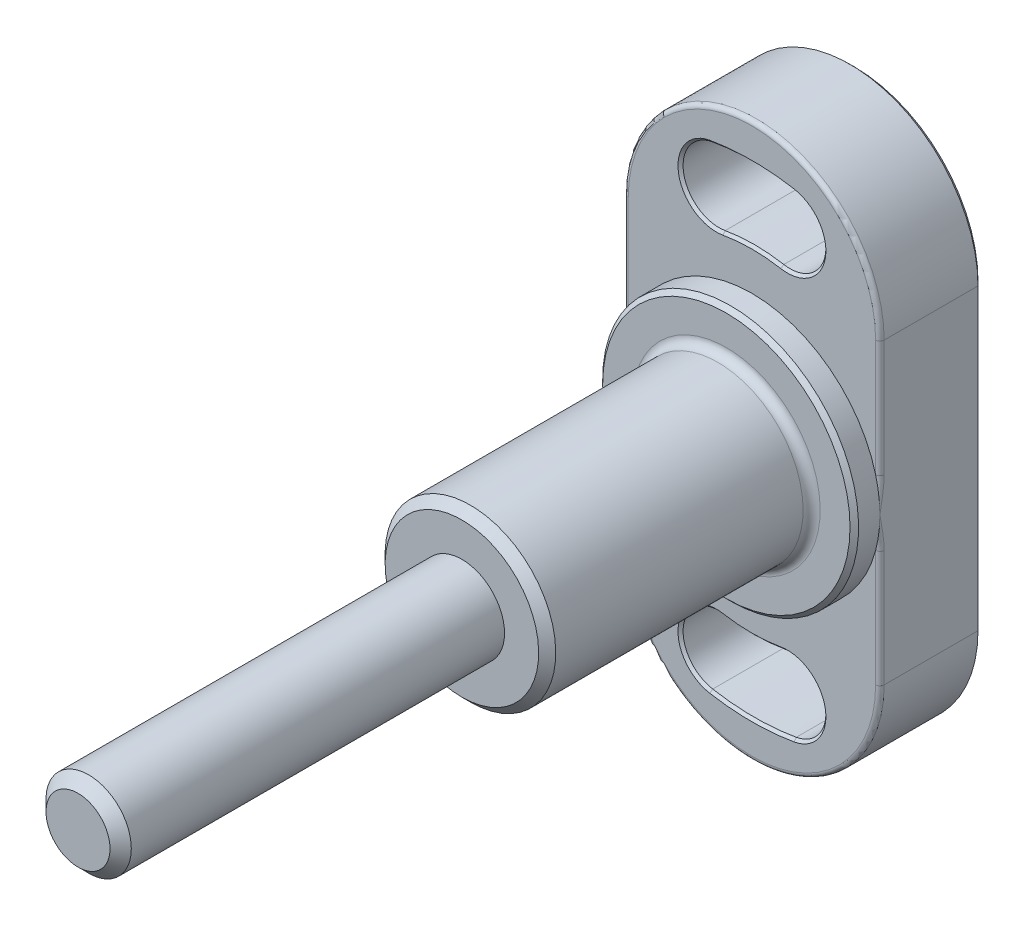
ISO-10303-21;
HEADER;
FILE_DESCRIPTION(('STEP AP214'),'2;1');
FILE_NAME('part.step','',(''),(''),'','','');
FILE_SCHEMA(('AUTOMOTIVE_DESIGN { 1 0 10303 214 1 1 1 1 }'));
ENDSEC;
DATA;
#1=APPLICATION_CONTEXT('core data for automotive mechanical design processes');
#2=APPLICATION_PROTOCOL_DEFINITION('international standard','automotive_design',2000,#1);
#3=PRODUCT_CONTEXT('',#1,'mechanical');
#4=PRODUCT('Part','Part','',(#3));
#5=PRODUCT_RELATED_PRODUCT_CATEGORY('part','',(#4));
#6=PRODUCT_DEFINITION_FORMATION('','',#4);
#7=PRODUCT_DEFINITION_CONTEXT('part definition',#1,'design');
#8=PRODUCT_DEFINITION('design','',#6,#7);
#9=PRODUCT_DEFINITION_SHAPE('','',#8);
#10=(LENGTH_UNIT() NAMED_UNIT(*) SI_UNIT(.MILLI.,.METRE.));
#11=(NAMED_UNIT(*) PLANE_ANGLE_UNIT() SI_UNIT($,.RADIAN.));
#12=(NAMED_UNIT(*) SI_UNIT($,.STERADIAN.) SOLID_ANGLE_UNIT());
#13=UNCERTAINTY_MEASURE_WITH_UNIT(LENGTH_MEASURE(1.E-05),#10,'distance_accuracy_value','');
#14=(GEOMETRIC_REPRESENTATION_CONTEXT(3) GLOBAL_UNCERTAINTY_ASSIGNED_CONTEXT((#13)) GLOBAL_UNIT_ASSIGNED_CONTEXT((#10,
#11,#12)) REPRESENTATION_CONTEXT('',''));
#15=CARTESIAN_POINT('',(0.,0.,0.));
#16=DIRECTION('',(0.,0.,1.));
#17=DIRECTION('',(1.,0.,0.));
#18=AXIS2_PLACEMENT_3D('',#15,#16,#17);
#19=CARTESIAN_POINT('',(10.,0.,46.));
#20=DIRECTION('',(0.,0.,1.));
#21=DIRECTION('',(0.,-1.,0.));
#22=AXIS2_PLACEMENT_3D('',#19,#20,#21);
#23=PLANE('',#22);
#24=CARTESIAN_POINT('',(0.,0.,46.));
#25=DIRECTION('',(0.,0.,1.));
#26=DIRECTION('',(1.,0.,0.));
#27=AXIS2_PLACEMENT_3D('',#24,#25,#26);
#28=CIRCLE('',#27,5.);
#29=CARTESIAN_POINT('',(5.,0.,46.));
#30=VERTEX_POINT('',#29);
#31=EDGE_CURVE('E643',#30,#30,#28,.T.);
#32=ORIENTED_EDGE('',*,*,#31,.F.);
#33=EDGE_LOOP('',(#32));
#34=FACE_BOUND('',#33,.T.);
#35=CARTESIAN_POINT('',(0.,0.,46.));
#36=DIRECTION('',(0.,0.,1.));
#37=DIRECTION('',(0.,-1.,0.));
#38=AXIS2_PLACEMENT_3D('',#35,#36,#37);
#39=CIRCLE('',#38,9.);
#40=CARTESIAN_POINT('',(0.,-9.,46.));
#41=VERTEX_POINT('',#40);
#42=EDGE_CURVE('E711',#41,#41,#39,.T.);
#43=ORIENTED_EDGE('',*,*,#42,.T.);
#44=EDGE_LOOP('',(#43));
#45=FACE_BOUND('',#44,.T.);
#46=ADVANCED_FACE('F14',(#34,#45),#23,.T.);
#47=CARTESIAN_POINT('',(0.,0.,0.));
#48=DIRECTION('',(0.,0.,-1.));
#49=DIRECTION('',(0.,1.,0.));
#50=AXIS2_PLACEMENT_3D('',#47,#48,#49);
#51=CYLINDRICAL_SURFACE('',#50,10.);
#52=CARTESIAN_POINT('',(0.,0.,45.));
#53=DIRECTION('',(0.,0.,1.));
#54=DIRECTION('',(0.,-1.,0.));
#55=AXIS2_PLACEMENT_3D('',#52,#53,#54);
#56=CIRCLE('',#55,10.);
#57=CARTESIAN_POINT('',(0.,-10.,45.));
#58=VERTEX_POINT('',#57);
#59=EDGE_CURVE('E708',#58,#58,#56,.F.);
#60=ORIENTED_EDGE('',*,*,#59,.T.);
#61=EDGE_LOOP('',(#60));
#62=FACE_BOUND('',#61,.T.);
#63=CARTESIAN_POINT('',(0.,0.,16.));
#64=DIRECTION('',(0.,0.,1.));
#65=DIRECTION('',(0.,-1.,0.));
#66=AXIS2_PLACEMENT_3D('',#63,#64,#65);
#67=CIRCLE('',#66,10.);
#68=CARTESIAN_POINT('',(0.,-10.,16.));
#69=VERTEX_POINT('',#68);
#70=EDGE_CURVE('E635',#69,#69,#67,.T.);
#71=ORIENTED_EDGE('',*,*,#70,.T.);
#72=EDGE_LOOP('',(#71));
#73=FACE_BOUND('',#72,.T.);
#74=ADVANCED_FACE('F439',(#62,#73),#51,.T.);
#75=CARTESIAN_POINT('',(10.,0.,15.));
#76=DIRECTION('',(0.,0.,1.));
#77=DIRECTION('',(0.,-1.,0.));
#78=AXIS2_PLACEMENT_3D('',#75,#76,#77);
#79=PLANE('',#78);
#80=CARTESIAN_POINT('',(0.,0.,15.));
#81=DIRECTION('',(0.,0.,1.));
#82=DIRECTION('',(0.,-1.,0.));
#83=AXIS2_PLACEMENT_3D('',#80,#81,#82);
#84=CIRCLE('',#83,14.5);
#85=CARTESIAN_POINT('',(0.,-14.5,15.));
#86=VERTEX_POINT('',#85);
#87=EDGE_CURVE('E704',#86,#86,#84,.T.);
#88=ORIENTED_EDGE('',*,*,#87,.T.);
#89=EDGE_LOOP('',(#88));
#90=FACE_BOUND('',#89,.T.);
#91=CARTESIAN_POINT('',(0.,0.,15.));
#92=DIRECTION('',(0.,0.,1.));
#93=DIRECTION('',(0.,-1.,0.));
#94=AXIS2_PLACEMENT_3D('',#91,#92,#93);
#95=CIRCLE('',#94,11.);
#96=CARTESIAN_POINT('',(0.,-11.,15.));
#97=VERTEX_POINT('',#96);
#98=EDGE_CURVE('E632',#97,#97,#95,.F.);
#99=ORIENTED_EDGE('',*,*,#98,.T.);
#100=EDGE_LOOP('',(#99));
#101=FACE_BOUND('',#100,.T.);
#102=ADVANCED_FACE('F446',(#90,#101),#79,.T.);
#103=CARTESIAN_POINT('',(0.,0.,0.));
#104=DIRECTION('',(0.,0.,-1.));
#105=DIRECTION('',(0.,1.,0.));
#106=AXIS2_PLACEMENT_3D('',#103,#104,#105);
#107=CYLINDRICAL_SURFACE('',#106,15.);
#108=CARTESIAN_POINT('',(0.,0.,14.5));
#109=DIRECTION('',(0.,0.,1.));
#110=DIRECTION('',(0.,-1.,0.));
#111=AXIS2_PLACEMENT_3D('',#108,#109,#110);
#112=CIRCLE('',#111,15.);
#113=CARTESIAN_POINT('',(0.,-15.,14.5));
#114=VERTEX_POINT('',#113);
#115=EDGE_CURVE('E701',#114,#114,#112,.F.);
#116=ORIENTED_EDGE('',*,*,#115,.T.);
#117=EDGE_LOOP('',(#116));
#118=FACE_BOUND('',#117,.T.);
#119=CARTESIAN_POINT('',(0.,0.,12.));
#120=DIRECTION('',(0.,0.,-1.));
#121=DIRECTION('',(0.,1.,0.));
#122=AXIS2_PLACEMENT_3D('',#119,#120,#121);
#123=CIRCLE('',#122,15.);
#124=CARTESIAN_POINT('',(15.,0.,12.));
#125=VERTEX_POINT('',#124);
#126=CARTESIAN_POINT('',(14.5,-3.8405728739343,12.));
#127=VERTEX_POINT('',#126);
#128=EDGE_CURVE('E226',#125,#127,#123,.T.);
#129=ORIENTED_EDGE('',*,*,#128,.F.);
#130=CARTESIAN_POINT('',(14.5,3.8405728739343,12.));
#131=VERTEX_POINT('',#130);
#132=EDGE_CURVE('E229',#131,#125,#123,.T.);
#133=ORIENTED_EDGE('',*,*,#132,.F.);
#134=CARTESIAN_POINT('',(-14.5,3.8405728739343,12.));
#135=VERTEX_POINT('',#134);
#136=EDGE_CURVE('E243',#135,#131,#123,.T.);
#137=ORIENTED_EDGE('',*,*,#136,.F.);
#138=CARTESIAN_POINT('',(-15.,0.,12.));
#139=VERTEX_POINT('',#138);
#140=EDGE_CURVE('E239',#139,#135,#123,.T.);
#141=ORIENTED_EDGE('',*,*,#140,.F.);
#142=CARTESIAN_POINT('',(-14.5,-3.8405728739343,12.));
#143=VERTEX_POINT('',#142);
#144=EDGE_CURVE('E238',#143,#139,#123,.T.);
#145=ORIENTED_EDGE('',*,*,#144,.F.);
#146=EDGE_CURVE('E232',#127,#143,#123,.T.);
#147=ORIENTED_EDGE('',*,*,#146,.F.);
#148=EDGE_LOOP('',(#129,#133,#137,#141,#145,#147));
#149=FACE_BOUND('',#148,.T.);
#150=ADVANCED_FACE('F227',(#118,#149),#107,.T.);
#151=CARTESIAN_POINT('',(0.,17.5,0.));
#152=DIRECTION('',(0.,0.,1.));
#153=DIRECTION('',(0.,-1.,0.));
#154=AXIS2_PLACEMENT_3D('',#151,#152,#153);
#155=PLANE('',#154);
#156=CARTESIAN_POINT('',(4.16755626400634,23.635386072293,0.));
#157=DIRECTION('',(0.,0.,1.));
#158=DIRECTION('',(0.,-1.,0.));
#159=AXIS2_PLACEMENT_3D('',#156,#157,#158);
#160=CIRCLE('',#159,4.5);
#161=CARTESIAN_POINT('',(3.38613946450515,19.203751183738,0.));
#162=VERTEX_POINT('',#161);
#163=CARTESIAN_POINT('',(4.94897306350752,28.067020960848,0.));
#164=VERTEX_POINT('',#163);
#165=EDGE_CURVE('E38',#162,#164,#160,.T.);
#166=ORIENTED_EDGE('',*,*,#165,.T.);
#167=CARTESIAN_POINT('',(0.,0.,0.));
#168=DIRECTION('',(0.,0.,1.));
#169=DIRECTION('',(0.,-1.,0.));
#170=AXIS2_PLACEMENT_3D('',#167,#168,#169);
#171=CIRCLE('',#170,28.5);
#172=CARTESIAN_POINT('',(-4.94897306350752,28.067020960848,0.));
#173=VERTEX_POINT('',#172);
#174=EDGE_CURVE('E705',#164,#173,#171,.T.);
#175=ORIENTED_EDGE('',*,*,#174,.T.);
#176=CARTESIAN_POINT('',(-4.16755626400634,23.635386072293,0.));
#177=DIRECTION('',(0.,0.,1.));
#178=DIRECTION('',(0.,-1.,0.));
#179=AXIS2_PLACEMENT_3D('',#176,#177,#178);
#180=CIRCLE('',#179,4.5);
#181=CARTESIAN_POINT('',(-3.38613946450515,19.203751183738,0.));
#182=VERTEX_POINT('',#181);
#183=EDGE_CURVE('E678',#173,#182,#180,.T.);
#184=ORIENTED_EDGE('',*,*,#183,.T.);
#185=CARTESIAN_POINT('',(0.,0.,0.));
#186=DIRECTION('',(0.,0.,1.));
#187=DIRECTION('',(0.,-1.,0.));
#188=AXIS2_PLACEMENT_3D('',#185,#186,#187);
#189=CIRCLE('',#188,19.5);
#190=EDGE_CURVE('E1164',#182,#162,#189,.F.);
#191=ORIENTED_EDGE('',*,*,#190,.T.);
#192=EDGE_LOOP('',(#166,#175,#184,#191));
#193=FACE_BOUND('',#192,.T.);
#194=CARTESIAN_POINT('',(-4.16755626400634,-23.635386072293,0.));
#195=DIRECTION('',(0.,0.,1.));
#196=DIRECTION('',(0.,-1.,0.));
#197=AXIS2_PLACEMENT_3D('',#194,#195,#196);
#198=CIRCLE('',#197,4.5);
#199=CARTESIAN_POINT('',(-3.38613946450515,-19.203751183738,0.));
#200=VERTEX_POINT('',#199);
#201=CARTESIAN_POINT('',(-4.94897306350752,-28.067020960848,0.));
#202=VERTEX_POINT('',#201);
#203=EDGE_CURVE('E1076',#200,#202,#198,.T.);
#204=ORIENTED_EDGE('',*,*,#203,.T.);
#205=CARTESIAN_POINT('',(0.,0.,0.));
#206=DIRECTION('',(0.,0.,1.));
#207=DIRECTION('',(0.,-1.,0.));
#208=AXIS2_PLACEMENT_3D('',#205,#206,#207);
#209=CIRCLE('',#208,28.5);
#210=CARTESIAN_POINT('',(4.94897306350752,-28.067020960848,0.));
#211=VERTEX_POINT('',#210);
#212=EDGE_CURVE('E1162',#202,#211,#209,.T.);
#213=ORIENTED_EDGE('',*,*,#212,.T.);
#214=CARTESIAN_POINT('',(4.16755626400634,-23.635386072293,0.));
#215=DIRECTION('',(0.,0.,1.));
#216=DIRECTION('',(0.,-1.,0.));
#217=AXIS2_PLACEMENT_3D('',#214,#215,#216);
#218=CIRCLE('',#217,4.5);
#219=CARTESIAN_POINT('',(3.38613946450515,-19.203751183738,0.));
#220=VERTEX_POINT('',#219);
#221=EDGE_CURVE('E1160',#211,#220,#218,.T.);
#222=ORIENTED_EDGE('',*,*,#221,.T.);
#223=CARTESIAN_POINT('',(0.,0.,0.));
#224=DIRECTION('',(0.,0.,1.));
#225=DIRECTION('',(0.,-1.,0.));
#226=AXIS2_PLACEMENT_3D('',#223,#224,#225);
#227=CIRCLE('',#226,19.5);
#228=EDGE_CURVE('E1157',#220,#200,#227,.F.);
#229=ORIENTED_EDGE('',*,*,#228,.T.);
#230=EDGE_LOOP('',(#204,#213,#222,#229));
#231=FACE_BOUND('',#230,.T.);
#232=CARTESIAN_POINT('',(0.,17.5,0.));
#233=DIRECTION('',(0.,0.,1.));
#234=DIRECTION('',(0.,-1.,0.));
#235=AXIS2_PLACEMENT_3D('',#232,#233,#234);
#236=CIRCLE('',#235,14.5);
#237=CARTESIAN_POINT('',(-14.5,17.5,0.));
#238=VERTEX_POINT('',#237);
#239=CARTESIAN_POINT('',(14.5,17.5,0.));
#240=VERTEX_POINT('',#239);
#241=EDGE_CURVE('E1080',#238,#240,#236,.F.);
#242=ORIENTED_EDGE('',*,*,#241,.T.);
#243=DIRECTION('',(0.,-1.,0.));
#244=VECTOR('',#243,1.);
#245=CARTESIAN_POINT('',(14.5,17.5,0.));
#246=LINE('',#245,#244);
#247=CARTESIAN_POINT('',(14.5,-17.5,0.));
#248=VERTEX_POINT('',#247);
#249=EDGE_CURVE('E1082',#240,#248,#246,.T.);
#250=ORIENTED_EDGE('',*,*,#249,.T.);
#251=CARTESIAN_POINT('',(0.,-17.5,0.));
#252=DIRECTION('',(0.,0.,1.));
#253=DIRECTION('',(0.,-1.,0.));
#254=AXIS2_PLACEMENT_3D('',#251,#252,#253);
#255=CIRCLE('',#254,14.5);
#256=CARTESIAN_POINT('',(-14.5,-17.5,0.));
#257=VERTEX_POINT('',#256);
#258=EDGE_CURVE('E1087',#248,#257,#255,.F.);
#259=ORIENTED_EDGE('',*,*,#258,.T.);
#260=DIRECTION('',(0.,1.,0.));
#261=VECTOR('',#260,1.);
#262=CARTESIAN_POINT('',(-14.5,17.5,0.));
#263=LINE('',#262,#261);
#264=EDGE_CURVE('E584',#257,#238,#263,.T.);
#265=ORIENTED_EDGE('',*,*,#264,.T.);
#266=EDGE_LOOP('',(#242,#250,#259,#265));
#267=FACE_BOUND('',#266,.T.);
#268=ADVANCED_FACE('F273',(#193,#231,#267),#155,.F.);
#269=CARTESIAN_POINT('',(0.,0.,12.));
#270=DIRECTION('',(0.,0.,-1.));
#271=DIRECTION('',(0.,1.,0.));
#272=AXIS2_PLACEMENT_3D('',#269,#270,#271);
#273=CYLINDRICAL_SURFACE('',#272,19.8);
#274=DIRECTION('',(0.,0.,-1.));
#275=VECTOR('',#274,1.);
#276=CARTESIAN_POINT('',(-3.43823391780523,19.4991935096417,12.));
#277=LINE('',#276,#275);
#278=CARTESIAN_POINT('',(-3.43823391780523,19.4991935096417,11.7));
#279=VERTEX_POINT('',#278);
#280=CARTESIAN_POINT('',(-3.43823391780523,19.4991935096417,0.3));
#281=VERTEX_POINT('',#280);
#282=EDGE_CURVE('E661',#279,#281,#277,.T.);
#283=ORIENTED_EDGE('',*,*,#282,.F.);
#284=CARTESIAN_POINT('',(0.,0.,11.7));
#285=DIRECTION('',(0.,0.,1.));
#286=DIRECTION('',(0.,-1.,0.));
#287=AXIS2_PLACEMENT_3D('',#284,#285,#286);
#288=CIRCLE('',#287,19.8);
#289=CARTESIAN_POINT('',(3.43823391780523,19.4991935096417,11.7));
#290=VERTEX_POINT('',#289);
#291=EDGE_CURVE('E1128',#279,#290,#288,.F.);
#292=ORIENTED_EDGE('',*,*,#291,.T.);
#293=DIRECTION('',(0.,0.,-1.));
#294=VECTOR('',#293,1.);
#295=CARTESIAN_POINT('',(3.43823391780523,19.4991935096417,12.));
#296=LINE('',#295,#294);
#297=CARTESIAN_POINT('',(3.43823391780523,19.4991935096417,0.3));
#298=VERTEX_POINT('',#297);
#299=EDGE_CURVE('E658',#290,#298,#296,.T.);
#300=ORIENTED_EDGE('',*,*,#299,.T.);
#301=CARTESIAN_POINT('',(0.,0.,0.3));
#302=DIRECTION('',(0.,0.,1.));
#303=DIRECTION('',(0.,-1.,0.));
#304=AXIS2_PLACEMENT_3D('',#301,#302,#303);
#305=CIRCLE('',#304,19.8);
#306=EDGE_CURVE('E1126',#298,#281,#305,.T.);
#307=ORIENTED_EDGE('',*,*,#306,.T.);
#308=EDGE_LOOP('',(#283,#292,#300,#307));
#309=FACE_BOUND('',#308,.T.);
#310=ADVANCED_FACE('F473',(#309),#273,.T.);
#311=CARTESIAN_POINT('',(4.16755626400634,23.635386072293,12.));
#312=DIRECTION('',(0.,0.,-1.));
#313=DIRECTION('',(0.,1.,0.));
#314=AXIS2_PLACEMENT_3D('',#311,#312,#313);
#315=CYLINDRICAL_SURFACE('',#314,4.2);
#316=ORIENTED_EDGE('',*,*,#299,.F.);
#317=CARTESIAN_POINT('',(4.16755626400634,23.635386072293,11.7));
#318=DIRECTION('',(0.,0.,1.));
#319=DIRECTION('',(0.,-1.,0.));
#320=AXIS2_PLACEMENT_3D('',#317,#318,#319);
#321=CIRCLE('',#320,4.2);
#322=CARTESIAN_POINT('',(4.89687861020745,27.7715786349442,11.7));
#323=VERTEX_POINT('',#322);
#324=EDGE_CURVE('E1124',#290,#323,#321,.T.);
#325=ORIENTED_EDGE('',*,*,#324,.T.);
#326=DIRECTION('',(0.,0.,-1.));
#327=VECTOR('',#326,1.);
#328=CARTESIAN_POINT('',(4.89687861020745,27.7715786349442,12.));
#329=LINE('',#328,#327);
#330=CARTESIAN_POINT('',(4.89687861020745,27.7715786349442,0.3));
#331=VERTEX_POINT('',#330);
#332=EDGE_CURVE('E655',#323,#331,#329,.T.);
#333=ORIENTED_EDGE('',*,*,#332,.T.);
#334=CARTESIAN_POINT('',(4.16755626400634,23.635386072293,0.3));
#335=DIRECTION('',(0.,0.,1.));
#336=DIRECTION('',(0.,-1.,0.));
#337=AXIS2_PLACEMENT_3D('',#334,#335,#336);
#338=CIRCLE('',#337,4.2);
#339=EDGE_CURVE('E1122',#331,#298,#338,.F.);
#340=ORIENTED_EDGE('',*,*,#339,.T.);
#341=EDGE_LOOP('',(#316,#325,#333,#340));
#342=FACE_BOUND('',#341,.T.);
#343=ADVANCED_FACE('F469',(#342),#315,.F.);
#344=CARTESIAN_POINT('',(0.,0.,12.));
#345=DIRECTION('',(0.,0.,-1.));
#346=DIRECTION('',(0.,1.,0.));
#347=AXIS2_PLACEMENT_3D('',#344,#345,#346);
#348=CYLINDRICAL_SURFACE('',#347,28.2);
#349=ORIENTED_EDGE('',*,*,#332,.F.);
#350=CARTESIAN_POINT('',(0.,0.,11.7));
#351=DIRECTION('',(0.,0.,1.));
#352=DIRECTION('',(0.,-1.,0.));
#353=AXIS2_PLACEMENT_3D('',#350,#351,#352);
#354=CIRCLE('',#353,28.2);
#355=CARTESIAN_POINT('',(-4.89687861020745,27.7715786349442,11.7));
#356=VERTEX_POINT('',#355);
#357=EDGE_CURVE('E670',#323,#356,#354,.T.);
#358=ORIENTED_EDGE('',*,*,#357,.T.);
#359=DIRECTION('',(0.,0.,-1.));
#360=VECTOR('',#359,1.);
#361=CARTESIAN_POINT('',(-4.89687861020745,27.7715786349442,12.));
#362=LINE('',#361,#360);
#363=CARTESIAN_POINT('',(-4.89687861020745,27.7715786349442,0.3));
#364=VERTEX_POINT('',#363);
#365=EDGE_CURVE('E626',#356,#364,#362,.T.);
#366=ORIENTED_EDGE('',*,*,#365,.T.);
#367=CARTESIAN_POINT('',(0.,0.,0.3));
#368=DIRECTION('',(0.,0.,1.));
#369=DIRECTION('',(0.,-1.,0.));
#370=AXIS2_PLACEMENT_3D('',#367,#368,#369);
#371=CIRCLE('',#370,28.2);
#372=EDGE_CURVE('E668',#364,#331,#371,.F.);
#373=ORIENTED_EDGE('',*,*,#372,.T.);
#374=EDGE_LOOP('',(#349,#358,#366,#373));
#375=FACE_BOUND('',#374,.T.);
#376=ADVANCED_FACE('F472',(#375),#348,.F.);
#377=CARTESIAN_POINT('',(-4.16755626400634,23.635386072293,12.));
#378=DIRECTION('',(0.,0.,-1.));
#379=DIRECTION('',(0.,1.,0.));
#380=AXIS2_PLACEMENT_3D('',#377,#378,#379);
#381=CYLINDRICAL_SURFACE('',#380,4.2);
#382=ORIENTED_EDGE('',*,*,#365,.F.);
#383=CARTESIAN_POINT('',(-4.16755626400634,23.635386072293,11.7));
#384=DIRECTION('',(0.,0.,1.));
#385=DIRECTION('',(0.,-1.,0.));
#386=AXIS2_PLACEMENT_3D('',#383,#384,#385);
#387=CIRCLE('',#386,4.2);
#388=EDGE_CURVE('E1120',#356,#279,#387,.T.);
#389=ORIENTED_EDGE('',*,*,#388,.T.);
#390=ORIENTED_EDGE('',*,*,#282,.T.);
#391=CARTESIAN_POINT('',(-4.16755626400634,23.635386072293,0.3));
#392=DIRECTION('',(0.,0.,1.));
#393=DIRECTION('',(0.,-1.,0.));
#394=AXIS2_PLACEMENT_3D('',#391,#392,#393);
#395=CIRCLE('',#394,4.2);
#396=EDGE_CURVE('E677',#281,#364,#395,.F.);
#397=ORIENTED_EDGE('',*,*,#396,.T.);
#398=EDGE_LOOP('',(#382,#389,#390,#397));
#399=FACE_BOUND('',#398,.T.);
#400=ADVANCED_FACE('F478',(#399),#381,.F.);
#401=CARTESIAN_POINT('',(0.,17.5,12.));
#402=DIRECTION('',(0.,0.,-1.));
#403=DIRECTION('',(0.,1.,0.));
#404=AXIS2_PLACEMENT_3D('',#401,#402,#403);
#405=CYLINDRICAL_SURFACE('',#404,15.);
#406=DIRECTION('',(0.,0.,-1.));
#407=VECTOR('',#406,1.);
#408=CARTESIAN_POINT('',(15.,17.5,12.));
#409=LINE('',#408,#407);
#410=CARTESIAN_POINT('',(15.,17.5,11.5));
#411=VERTEX_POINT('',#410);
#412=CARTESIAN_POINT('',(15.,17.5,0.499999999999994));
#413=VERTEX_POINT('',#412);
#414=EDGE_CURVE('E622',#411,#413,#409,.T.);
#415=ORIENTED_EDGE('',*,*,#414,.T.);
#416=CARTESIAN_POINT('',(0.,17.5,0.499999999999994));
#417=DIRECTION('',(0.,0.,1.));
#418=DIRECTION('',(0.,-1.,0.));
#419=AXIS2_PLACEMENT_3D('',#416,#417,#418);
#420=CIRCLE('',#419,15.);
#421=CARTESIAN_POINT('',(-15.,17.5,0.499999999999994));
#422=VERTEX_POINT('',#421);
#423=EDGE_CURVE('E1094',#413,#422,#420,.T.);
#424=ORIENTED_EDGE('',*,*,#423,.T.);
#425=DIRECTION('',(0.,0.,-1.));
#426=VECTOR('',#425,1.);
#427=CARTESIAN_POINT('',(-15.,17.5,12.));
#428=LINE('',#427,#426);
#429=CARTESIAN_POINT('',(-15.,17.5,11.5));
#430=VERTEX_POINT('',#429);
#431=EDGE_CURVE('E624',#430,#422,#428,.T.);
#432=ORIENTED_EDGE('',*,*,#431,.F.);
#433=CARTESIAN_POINT('',(0.,17.5,11.5));
#434=DIRECTION('',(0.,0.,1.));
#435=DIRECTION('',(0.,-1.,0.));
#436=AXIS2_PLACEMENT_3D('',#433,#434,#435);
#437=CIRCLE('',#436,15.);
#438=EDGE_CURVE('E538',#430,#411,#437,.F.);
#439=ORIENTED_EDGE('',*,*,#438,.T.);
#440=EDGE_LOOP('',(#415,#424,#432,#439));
#441=FACE_BOUND('',#440,.T.);
#442=ADVANCED_FACE('F461',(#441),#405,.T.);
#443=CARTESIAN_POINT('',(-4.16755626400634,-23.635386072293,12.));
#444=DIRECTION('',(0.,0.,-1.));
#445=DIRECTION('',(0.,1.,0.));
#446=AXIS2_PLACEMENT_3D('',#443,#444,#445);
#447=CYLINDRICAL_SURFACE('',#446,4.2);
#448=DIRECTION('',(0.,0.,-1.));
#449=VECTOR('',#448,1.);
#450=CARTESIAN_POINT('',(-3.43823391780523,-19.4991935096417,12.));
#451=LINE('',#450,#449);
#452=CARTESIAN_POINT('',(-3.43823391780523,-19.4991935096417,11.7));
#453=VERTEX_POINT('',#452);
#454=CARTESIAN_POINT('',(-3.43823391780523,-19.4991935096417,0.3));
#455=VERTEX_POINT('',#454);
#456=EDGE_CURVE('E649',#453,#455,#451,.T.);
#457=ORIENTED_EDGE('',*,*,#456,.F.);
#458=CARTESIAN_POINT('',(-4.16755626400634,-23.635386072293,11.7));
#459=DIRECTION('',(0.,0.,1.));
#460=DIRECTION('',(0.,-1.,0.));
#461=AXIS2_PLACEMENT_3D('',#458,#459,#460);
#462=CIRCLE('',#461,4.2);
#463=CARTESIAN_POINT('',(-4.89687861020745,-27.7715786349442,11.7));
#464=VERTEX_POINT('',#463);
#465=EDGE_CURVE('E1151',#453,#464,#462,.T.);
#466=ORIENTED_EDGE('',*,*,#465,.T.);
#467=DIRECTION('',(0.,0.,-1.));
#468=VECTOR('',#467,1.);
#469=CARTESIAN_POINT('',(-4.89687861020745,-27.7715786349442,12.));
#470=LINE('',#469,#468);
#471=CARTESIAN_POINT('',(-4.89687861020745,-27.7715786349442,0.3));
#472=VERTEX_POINT('',#471);
#473=EDGE_CURVE('E646',#464,#472,#470,.T.);
#474=ORIENTED_EDGE('',*,*,#473,.T.);
#475=CARTESIAN_POINT('',(-4.16755626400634,-23.635386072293,0.3));
#476=DIRECTION('',(0.,0.,1.));
#477=DIRECTION('',(0.,-1.,0.));
#478=AXIS2_PLACEMENT_3D('',#475,#476,#477);
#479=CIRCLE('',#478,4.2);
#480=EDGE_CURVE('E1149',#472,#455,#479,.F.);
#481=ORIENTED_EDGE('',*,*,#480,.T.);
#482=EDGE_LOOP('',(#457,#466,#474,#481));
#483=FACE_BOUND('',#482,.T.);
#484=ADVANCED_FACE('F457',(#483),#447,.F.);
#485=CARTESIAN_POINT('',(0.,0.,12.));
#486=DIRECTION('',(0.,0.,-1.));
#487=DIRECTION('',(0.,1.,0.));
#488=AXIS2_PLACEMENT_3D('',#485,#486,#487);
#489=CYLINDRICAL_SURFACE('',#488,28.2);
#490=ORIENTED_EDGE('',*,*,#473,.F.);
#491=CARTESIAN_POINT('',(0.,0.,11.7));
#492=DIRECTION('',(0.,0.,1.));
#493=DIRECTION('',(0.,-1.,0.));
#494=AXIS2_PLACEMENT_3D('',#491,#492,#493);
#495=CIRCLE('',#494,28.2);
#496=CARTESIAN_POINT('',(4.89687861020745,-27.7715786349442,11.7));
#497=VERTEX_POINT('',#496);
#498=EDGE_CURVE('E1133',#464,#497,#495,.T.);
#499=ORIENTED_EDGE('',*,*,#498,.T.);
#500=DIRECTION('',(0.,0.,-1.));
#501=VECTOR('',#500,1.);
#502=CARTESIAN_POINT('',(4.89687861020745,-27.7715786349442,12.));
#503=LINE('',#502,#501);
#504=CARTESIAN_POINT('',(4.89687861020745,-27.7715786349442,0.3));
#505=VERTEX_POINT('',#504);
#506=EDGE_CURVE('E236',#497,#505,#503,.T.);
#507=ORIENTED_EDGE('',*,*,#506,.T.);
#508=CARTESIAN_POINT('',(0.,0.,0.3));
#509=DIRECTION('',(0.,0.,1.));
#510=DIRECTION('',(0.,-1.,0.));
#511=AXIS2_PLACEMENT_3D('',#508,#509,#510);
#512=CIRCLE('',#511,28.2);
#513=EDGE_CURVE('E1130',#505,#472,#512,.F.);
#514=ORIENTED_EDGE('',*,*,#513,.T.);
#515=EDGE_LOOP('',(#490,#499,#507,#514));
#516=FACE_BOUND('',#515,.T.);
#517=ADVANCED_FACE('F453',(#516),#489,.F.);
#518=CARTESIAN_POINT('',(4.16755626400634,-23.635386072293,12.));
#519=DIRECTION('',(0.,0.,-1.));
#520=DIRECTION('',(0.,1.,0.));
#521=AXIS2_PLACEMENT_3D('',#518,#519,#520);
#522=CYLINDRICAL_SURFACE('',#521,4.2);
#523=ORIENTED_EDGE('',*,*,#506,.F.);
#524=CARTESIAN_POINT('',(4.16755626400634,-23.635386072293,11.7));
#525=DIRECTION('',(0.,0.,1.));
#526=DIRECTION('',(0.,-1.,0.));
#527=AXIS2_PLACEMENT_3D('',#524,#525,#526);
#528=CIRCLE('',#527,4.2);
#529=CARTESIAN_POINT('',(3.43823391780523,-19.4991935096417,11.7));
#530=VERTEX_POINT('',#529);
#531=EDGE_CURVE('E1147',#497,#530,#528,.T.);
#532=ORIENTED_EDGE('',*,*,#531,.T.);
#533=DIRECTION('',(0.,0.,-1.));
#534=VECTOR('',#533,1.);
#535=CARTESIAN_POINT('',(3.43823391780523,-19.4991935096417,12.));
#536=LINE('',#535,#534);
#537=CARTESIAN_POINT('',(3.43823391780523,-19.4991935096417,0.3));
#538=VERTEX_POINT('',#537);
#539=EDGE_CURVE('E652',#530,#538,#536,.T.);
#540=ORIENTED_EDGE('',*,*,#539,.T.);
#541=CARTESIAN_POINT('',(4.16755626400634,-23.635386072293,0.3));
#542=DIRECTION('',(0.,0.,1.));
#543=DIRECTION('',(0.,-1.,0.));
#544=AXIS2_PLACEMENT_3D('',#541,#542,#543);
#545=CIRCLE('',#544,4.2);
#546=EDGE_CURVE('E1145',#538,#505,#545,.F.);
#547=ORIENTED_EDGE('',*,*,#546,.T.);
#548=EDGE_LOOP('',(#523,#532,#540,#547));
#549=FACE_BOUND('',#548,.T.);
#550=ADVANCED_FACE('F456',(#549),#522,.F.);
#551=CARTESIAN_POINT('',(0.,0.,12.));
#552=DIRECTION('',(0.,0.,-1.));
#553=DIRECTION('',(0.,1.,0.));
#554=AXIS2_PLACEMENT_3D('',#551,#552,#553);
#555=CYLINDRICAL_SURFACE('',#554,19.8);
#556=ORIENTED_EDGE('',*,*,#539,.F.);
#557=CARTESIAN_POINT('',(0.,0.,11.7));
#558=DIRECTION('',(0.,0.,1.));
#559=DIRECTION('',(0.,-1.,0.));
#560=AXIS2_PLACEMENT_3D('',#557,#558,#559);
#561=CIRCLE('',#560,19.8);
#562=EDGE_CURVE('E1155',#530,#453,#561,.F.);
#563=ORIENTED_EDGE('',*,*,#562,.T.);
#564=ORIENTED_EDGE('',*,*,#456,.T.);
#565=CARTESIAN_POINT('',(0.,0.,0.3));
#566=DIRECTION('',(0.,0.,1.));
#567=DIRECTION('',(0.,-1.,0.));
#568=AXIS2_PLACEMENT_3D('',#565,#566,#567);
#569=CIRCLE('',#568,19.8);
#570=EDGE_CURVE('E1153',#455,#538,#569,.T.);
#571=ORIENTED_EDGE('',*,*,#570,.T.);
#572=EDGE_LOOP('',(#556,#563,#564,#571));
#573=FACE_BOUND('',#572,.T.);
#574=ADVANCED_FACE('F272',(#573),#555,.T.);
#575=CARTESIAN_POINT('',(15.,17.5,12.));
#576=DIRECTION('',(-1.,0.,0.));
#577=DIRECTION('',(0.,-1.,0.));
#578=AXIS2_PLACEMENT_3D('',#575,#576,#577);
#579=PLANE('',#578);
#580=DIRECTION('',(0.,0.,-1.));
#581=VECTOR('',#580,1.);
#582=CARTESIAN_POINT('',(15.,-17.5,12.));
#583=LINE('',#582,#581);
#584=CARTESIAN_POINT('',(15.,-17.5,11.5));
#585=VERTEX_POINT('',#584);
#586=CARTESIAN_POINT('',(15.,-17.5,0.499999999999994));
#587=VERTEX_POINT('',#586);
#588=EDGE_CURVE('E615',#585,#587,#583,.T.);
#589=ORIENTED_EDGE('',*,*,#588,.T.);
#590=DIRECTION('',(0.,1.,0.));
#591=VECTOR('',#590,1.);
#592=CARTESIAN_POINT('',(15.,17.5,0.499999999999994));
#593=LINE('',#592,#591);
#594=EDGE_CURVE('E337',#587,#413,#593,.T.);
#595=ORIENTED_EDGE('',*,*,#594,.T.);
#596=ORIENTED_EDGE('',*,*,#414,.F.);
#597=DIRECTION('',(0.,1.,0.));
#598=VECTOR('',#597,1.);
#599=CARTESIAN_POINT('',(15.,0.,11.5));
#600=LINE('',#599,#598);
#601=CARTESIAN_POINT('',(15.,3.8405728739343,11.5));
#602=VERTEX_POINT('',#601);
#603=EDGE_CURVE('E217',#411,#602,#600,.F.);
#604=ORIENTED_EDGE('',*,*,#603,.T.);
#605=CARTESIAN_POINT('',(14.185673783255,4.87510608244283,12.));
#606=CARTESIAN_POINT('',(14.4308988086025,4.82003659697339,12.1904278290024));
#607=CARTESIAN_POINT('',(14.7154494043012,4.85778301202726,12.0599024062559));
#608=CARTESIAN_POINT('',(15.,4.89552942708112,11.9293769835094));
#609=CARTESIAN_POINT('',(15.,4.98312868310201,11.6264626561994));
#610=CARTESIAN_POINT('',(14.1999027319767,4.83370691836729,12.));
#611=CARTESIAN_POINT('',(14.4472952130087,4.78697960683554,12.1792969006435));
#612=CARTESIAN_POINT('',(14.7236897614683,4.82202754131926,12.0454610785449));
#613=CARTESIAN_POINT('',(15.,4.85749880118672,11.9117765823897));
#614=CARTESIAN_POINT('',(15.,4.9358126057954,11.6128365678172));
#615=CARTESIAN_POINT('',(14.2141201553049,4.79174292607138,12.));
#616=CARTESIAN_POINT('',(14.4628891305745,4.75158482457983,12.1683482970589));
#617=CARTESIAN_POINT('',(14.7314806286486,4.7842958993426,12.0318535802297));
#618=CARTESIAN_POINT('',(15.,4.81740548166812,11.8954843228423));
#619=CARTESIAN_POINT('',(15.,4.88806808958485,11.6008401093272));
#620=CARTESIAN_POINT('',(14.2424242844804,4.70694532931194,12.));
#621=CARTESIAN_POINT('',(14.4925191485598,4.67765986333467,12.1471868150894));
#622=CARTESIAN_POINT('',(14.7462977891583,4.70595521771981,12.0062663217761));
#623=CARTESIAN_POINT('',(15.,4.73463769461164,11.8654769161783));
#624=CARTESIAN_POINT('',(15.,4.79202360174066,11.5795570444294));
#625=CARTESIAN_POINT('',(14.2565111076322,4.66411264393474,12.));
#626=CARTESIAN_POINT('',(14.5065891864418,4.6391216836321,12.1369538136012));
#627=CARTESIAN_POINT('',(14.7533248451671,4.66534911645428,11.9942849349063));
#628=CARTESIAN_POINT('',(15.,4.69194412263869,11.8517164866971));
#629=CARTESIAN_POINT('',(15.,4.74372423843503,11.57026771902));
#630=CARTESIAN_POINT('',(14.2844323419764,4.57788643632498,12.));
#631=CARTESIAN_POINT('',(14.5334302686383,4.56006692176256,12.1174390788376));
#632=CARTESIAN_POINT('',(14.7667441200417,4.5823862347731,11.9719156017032));
#633=CARTESIAN_POINT('',(15.,4.60507035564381,11.8264891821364));
#634=CARTESIAN_POINT('',(15.,4.64692445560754,11.5538496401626));
#635=CARTESIAN_POINT('',(14.2982673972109,4.53449504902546,12.));
#636=CARTESIAN_POINT('',(14.5462279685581,4.51954018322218,12.1081378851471));
#637=CARTESIAN_POINT('',(14.7731382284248,4.54003523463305,11.9615228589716));
#638=CARTESIAN_POINT('',(15.,4.56087090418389,11.8149846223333));
#639=CARTESIAN_POINT('',(15.,4.59842511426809,11.5467143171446));
#640=CARTESIAN_POINT('',(14.3256841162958,4.44711949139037,12.));
#641=CARTESIAN_POINT('',(14.5707712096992,4.43691362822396,12.0904385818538));
#642=CARTESIAN_POINT('',(14.7854096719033,4.4539478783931,11.9421401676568));
#643=CARTESIAN_POINT('',(15.,4.47131934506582,11.7939175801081));
#644=CARTESIAN_POINT('',(15.,4.50118580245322,11.5342294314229));
#645=CARTESIAN_POINT('',(14.339265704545,4.40313515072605,12.));
#646=CARTESIAN_POINT('',(14.582533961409,4.3947943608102,12.0820269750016));
#647=CARTESIAN_POINT('',(14.7912868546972,4.41021111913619,11.9331506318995));
#648=CARTESIAN_POINT('',(15.,4.42594200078,11.784332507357));
#649=CARTESIAN_POINT('',(15.,4.45244576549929,11.528880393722));
#650=CARTESIAN_POINT('',(14.3793254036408,4.2712282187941,12.));
#651=CARTESIAN_POINT('',(14.6161467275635,4.26789348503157,12.0583366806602));
#652=CARTESIAN_POINT('',(14.8081521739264,4.27829233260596,11.9082386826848));
#653=CARTESIAN_POINT('',(15.,4.28991775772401,11.7583744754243));
#654=CARTESIAN_POINT('',(15.,4.30689436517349,11.5151876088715));
#655=CARTESIAN_POINT('',(14.4053721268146,4.1825694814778,12.));
#656=CARTESIAN_POINT('',(14.6368699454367,4.18084594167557,12.0441973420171));
#657=CARTESIAN_POINT('',(14.8184923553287,4.18863761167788,11.8941760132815));
#658=CARTESIAN_POINT('',(15.,4.19749690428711,11.7442986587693));
#659=CARTESIAN_POINT('',(15.,4.20987372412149,11.509060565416));
#660=CARTESIAN_POINT('',(14.4561333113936,4.0036081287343,12.));
#661=CARTESIAN_POINT('',(14.675539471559,4.00386221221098,12.0189870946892));
#662=CARTESIAN_POINT('',(14.8378251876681,4.00689595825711,11.8701311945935));
#663=CARTESIAN_POINT('',(15.,4.01098340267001,11.721412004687));
#664=CARTESIAN_POINT('',(15.,4.01558600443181,11.5013556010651));
#665=CARTESIAN_POINT('',(14.4808464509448,3.91330399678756,12.));
#666=CARTESIAN_POINT('',(14.6935508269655,3.91379350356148,12.0078604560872));
#667=CARTESIAN_POINT('',(14.8468165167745,3.91480674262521,11.8601530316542));
#668=CARTESIAN_POINT('',(15.,3.91673656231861,11.712524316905));
#669=CARTESIAN_POINT('',(15.,3.91831877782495,11.4997821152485));
#670=CARTESIAN_POINT('',(14.5440442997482,3.6734795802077,12.));
#671=CARTESIAN_POINT('',(14.7378916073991,3.67459584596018,11.9821196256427));
#672=CARTESIAN_POINT('',(14.8690574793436,3.67002882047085,11.838314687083));
#673=CARTESIAN_POINT('',(15.,3.6679008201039,11.6947323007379));
#674=CARTESIAN_POINT('',(15.,3.66192628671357,11.5004219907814));
#675=CARTESIAN_POINT('',(14.5812893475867,3.52283182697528,12.));
#676=CARTESIAN_POINT('',(14.7626122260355,3.52272499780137,11.9695190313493));
#677=CARTESIAN_POINT('',(14.8813776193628,3.51605500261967,11.8292949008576));
#678=CARTESIAN_POINT('',(15.,3.51134329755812,11.6891467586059));
#679=CARTESIAN_POINT('',(15.,3.50281056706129,11.5056809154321));
#680=CARTESIAN_POINT('',(14.6514491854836,3.2186070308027,12.));
#681=CARTESIAN_POINT('',(14.807292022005,3.2161749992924,11.9499722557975));
#682=CARTESIAN_POINT('',(14.903714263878,3.20589367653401,11.8180832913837));
#683=CARTESIAN_POINT('',(15.,3.197535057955,11.6862586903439));
#684=CARTESIAN_POINT('',(15.,3.18495584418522,11.5232619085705));
#685=CARTESIAN_POINT('',(14.684362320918,3.06502889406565,12.));
#686=CARTESIAN_POINT('',(14.8273706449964,3.06110184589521,11.9429309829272));
#687=CARTESIAN_POINT('',(14.9137298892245,3.04970534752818,11.8158940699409));
#688=CARTESIAN_POINT('',(15.,3.03985484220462,11.6888527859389));
#689=CARTESIAN_POINT('',(15.,3.02621700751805,11.5355866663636));
#690=CARTESIAN_POINT('',(14.7456026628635,2.75538011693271,12.));
#691=CARTESIAN_POINT('',(14.8635844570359,2.74912309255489,11.9332924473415));
#692=CARTESIAN_POINT('',(14.931836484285,2.73595159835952,11.8167708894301));
#693=CARTESIAN_POINT('',(15.,2.72431238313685,11.7002450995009));
#694=CARTESIAN_POINT('',(15.,2.70915717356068,11.5655812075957));
#695=CARTESIAN_POINT('',(14.7739270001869,2.5993079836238,12.));
#696=CARTESIAN_POINT('',(14.8797958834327,2.59188688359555,11.9306439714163));
#697=CARTESIAN_POINT('',(14.9399262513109,2.57838538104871,11.8198402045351));
#698=CARTESIAN_POINT('',(15.,2.56610052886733,11.7089994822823));
#699=CARTESIAN_POINT('',(15.,2.55083649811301,11.5832543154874));
#700=CARTESIAN_POINT('',(14.8257645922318,2.28518355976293,12.));
#701=CARTESIAN_POINT('',(14.9087752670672,2.27629701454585,11.9288211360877));
#702=CARTESIAN_POINT('',(14.9544147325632,2.26247177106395,11.8300229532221));
#703=CARTESIAN_POINT('',(15.,2.24984605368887,11.7311838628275));
#704=CARTESIAN_POINT('',(15.,2.23469494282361,11.6226569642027));
#705=CARTESIAN_POINT('',(14.8492773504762,2.12713106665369,12.));
#706=CARTESIAN_POINT('',(14.9215959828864,2.11765812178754,11.9296190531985));
#707=CARTESIAN_POINT('',(14.9608132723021,2.10412429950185,11.8371368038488));
#708=CARTESIAN_POINT('',(15.,2.0915079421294,11.7445994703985));
#709=CARTESIAN_POINT('',(15.,2.07687411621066,11.6443869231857));
#710=CARTESIAN_POINT('',(14.9126243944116,1.64850858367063,12.));
#711=CARTESIAN_POINT('',(14.9554554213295,1.64005426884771,11.9359836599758));
#712=CARTESIAN_POINT('',(14.9777963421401,1.62629223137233,11.8631339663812));
#713=CARTESIAN_POINT('',(15.,1.61627727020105,11.7900907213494));
#714=CARTESIAN_POINT('',(15.,1.60199575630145,11.7143989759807));
#715=CARTESIAN_POINT('',(14.944855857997,1.32553957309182,12.));
#716=CARTESIAN_POINT('',(14.9720715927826,1.31713375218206,11.9455352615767));
#717=CARTESIAN_POINT('',(14.9860529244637,1.30611016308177,11.8866390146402));
#718=CARTESIAN_POINT('',(15.,1.29690527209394,11.8276060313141));
#719=CARTESIAN_POINT('',(15.,1.28562567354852,11.7672750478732));
#720=CARTESIAN_POINT('',(14.9882629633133,0.676558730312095,12.));
#721=CARTESIAN_POINT('',(14.9941421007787,0.671823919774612,11.9696596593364));
#722=CARTESIAN_POINT('',(14.9970846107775,0.665317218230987,11.9393427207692));
#723=CARTESIAN_POINT('',(15.,0.660555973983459,11.9088694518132));
#724=CARTESIAN_POINT('',(15.,0.6540603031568,11.8786148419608));
#725=CARTESIAN_POINT('',(14.9994473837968,0.350548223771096,12.));
#726=CARTESIAN_POINT('',(14.9997238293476,0.347649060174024,11.9842692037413));
#727=CARTESIAN_POINT('',(14.9998620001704,0.344706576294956,11.9685389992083));
#728=CARTESIAN_POINT('',(15.,0.341806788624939,11.9528049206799));
#729=CARTESIAN_POINT('',(15.,0.338864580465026,11.9370762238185));
#730=CARTESIAN_POINT('',(14.9999866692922,0.020412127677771,12.));
#731=CARTESIAN_POINT('',(14.99999333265,0.0202420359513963,11.9990839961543));
#732=CARTESIAN_POINT('',(14.9999966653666,0.0200719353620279,11.9981679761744));
#733=CARTESIAN_POINT('',(15.,0.0199018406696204,11.9972519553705));
#734=CARTESIAN_POINT('',(15.,0.0197317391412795,11.9963359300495));
#735=CARTESIAN_POINT('',(14.9999916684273,0.0163293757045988,12.));
#736=CARTESIAN_POINT('',(14.9999958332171,0.0161933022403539,11.9992672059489));
#737=CARTESIAN_POINT('',(14.9999979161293,0.0160572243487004,11.9985344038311));
#738=CARTESIAN_POINT('',(15.,0.0159211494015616,11.9978016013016));
#739=CARTESIAN_POINT('',(15.,0.0157850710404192,11.9970687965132));
#740=CARTESIAN_POINT('',(14.9999983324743,0.00816441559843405,12.));
#741=CARTESIAN_POINT('',(14.9999991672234,0.00809638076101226,11.9996336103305));
#742=CARTESIAN_POINT('',(14.9999995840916,0.00802834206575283,11.9992672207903));
#743=CARTESIAN_POINT('',(15.,0.00796030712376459,11.9989008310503));
#744=CARTESIAN_POINT('',(15.,0.00789226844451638,11.9985344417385));
#745=CARTESIAN_POINT('',(14.9999999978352,0.00408220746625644,12.));
#746=CARTESIAN_POINT('',(15.0000000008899,0.00404818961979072,11.9998168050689));
#747=CARTESIAN_POINT('',(15.0000000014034,0.00401417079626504,11.9996336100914));
#748=CARTESIAN_POINT('',(15.,0.00398015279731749,11.9994504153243));
#749=CARTESIAN_POINT('',(15.,0.00394613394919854,11.9992672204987));
#750=CARTESIAN_POINT('',(15.,0.,12.));
#751=CARTESIAN_POINT('',(15.,0.,12.));
#752=CARTESIAN_POINT('',(15.,0.,12.));
#753=CARTESIAN_POINT('',(15.,0.,12.));
#754=CARTESIAN_POINT('',(15.,0.,12.));
#755=(BOUNDED_SURFACE() B_SPLINE_SURFACE(3,2,((#605,#606,#607,#608,#609),(#610,#611,#612,#613,
#614),(#615,#616,#617,#618,#619),(#620,#621,#622,#623,#624),(#625,#626,#627,#628,#629),(#630,
#631,#632,#633,#634),(#635,#636,#637,#638,#639),(#640,#641,#642,#643,#644),(#645,#646,#647,#648,
#649),(#650,#651,#652,#653,#654),(#655,#656,#657,#658,#659),(#660,#661,#662,#663,#664),(#665,
#666,#667,#668,#669),(#670,#671,#672,#673,#674),(#675,#676,#677,#678,#679),(#680,#681,#682,#683,
#684),(#685,#686,#687,#688,#689),(#690,#691,#692,#693,#694),(#695,#696,#697,#698,#699),(#700,
#701,#702,#703,#704),(#705,#706,#707,#708,#709),(#710,#711,#712,#713,#714),(#715,#716,#717,#718,
#719),(#720,#721,#722,#723,#724),(#725,#726,#727,#728,#729),(#730,#731,#732,#733,#734),(#735,
#736,#737,#738,#739),(#740,#741,#742,#743,#744),(#745,#746,#747,#748,#749),(#750,#751,#752,#753,
#754)),.UNSPECIFIED.,.F.,.F.,.F.) B_SPLINE_SURFACE_WITH_KNOTS((4,2,2,2,2,2,2,2,2,2,2,2,2,2,4),
(3,2,3),(0.,0.14763163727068,0.295114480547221,0.442142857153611,0.589214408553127,
0.880696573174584,1.17246254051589,1.6498249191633,2.1273691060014,2.60521073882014,
3.08310165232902,4.0452252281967,5.00694741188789,5.01898981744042,5.0310306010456),(0.,0.5,1.),
.UNSPECIFIED.) GEOMETRIC_REPRESENTATION_ITEM() RATIONAL_B_SPLINE_SURFACE(((1.,0.84584242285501,
1.,0.84584242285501,1.),(1.,0.85071187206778,1.,0.85071187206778,1.),(1.,0.855276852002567,1.,
0.855276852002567,1.),(1.,0.863896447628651,1.,0.863896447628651,1.),(1.,0.867951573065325,1.,
0.867951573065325,1.),(1.,0.875647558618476,1.,0.875647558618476,1.),(1.,0.879289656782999,1.,
0.879289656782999,1.),(1.,0.88624023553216,1.,0.88624023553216,1.),(1.,0.88954861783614,1.,
0.88954861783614,1.),(1.,0.898994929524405,1.,0.898994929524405,1.),(1.,0.904721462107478,1.,
0.904721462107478,1.),(1.,0.915343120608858,1.,0.915343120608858,1.),(1.,0.920237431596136,1.,
0.920237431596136,1.),(1.,0.932262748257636,1.,0.932262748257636,1.),(1.,0.938836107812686,1.,
0.938836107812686,1.),(1.,0.950656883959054,1.,0.950656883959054,1.),(1.,0.955903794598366,1.,
0.955903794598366,1.),(1.,0.965328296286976,1.,0.965328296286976,1.),(1.,0.969505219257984,1.,
0.969505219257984,1.),(1.,0.976948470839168,1.,0.976948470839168,1.),(1.,0.98021470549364,1.,
0.98021470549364,1.),(1.,0.988853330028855,1.,0.988853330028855,1.),(1.,0.993006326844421,1.,
0.993006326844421,1.),(1.,0.998544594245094,1.,0.998544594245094,1.),(1.,0.999931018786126,1.,
0.999931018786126,1.),(1.,0.999998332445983,1.,0.999998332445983,1.),(1.,0.999998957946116,1.,
0.999998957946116,1.),(1.,0.999999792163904,1.,0.999999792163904,1.),(1.,1.00000000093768,1.,
1.00000000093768,1.),(1.,1.,1.,1.,1.))) REPRESENTATION_ITEM('') SURFACE());
#756=CARTESIAN_POINT('',(15.,4.98312868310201,11.6264626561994));
#757=CARTESIAN_POINT('',(15.,4.9358126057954,11.6128365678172));
#758=CARTESIAN_POINT('',(15.,4.88806808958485,11.6008401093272));
#759=CARTESIAN_POINT('',(15.,4.79202360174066,11.5795570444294));
#760=CARTESIAN_POINT('',(15.,4.74372423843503,11.57026771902));
#761=CARTESIAN_POINT('',(15.,4.64692445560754,11.5538496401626));
#762=CARTESIAN_POINT('',(15.,4.59842511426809,11.5467143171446));
#763=CARTESIAN_POINT('',(15.,4.50118580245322,11.5342294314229));
#764=CARTESIAN_POINT('',(15.,4.45244576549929,11.528880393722));
#765=CARTESIAN_POINT('',(15.,4.30689436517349,11.5151876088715));
#766=CARTESIAN_POINT('',(15.,4.20987372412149,11.509060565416));
#767=CARTESIAN_POINT('',(15.,4.0155860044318,11.5013556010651));
#768=CARTESIAN_POINT('',(15.,3.91831877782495,11.4997821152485));
#769=CARTESIAN_POINT('',(15.,3.66192628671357,11.5004219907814));
#770=CARTESIAN_POINT('',(15.,3.50281056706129,11.5056809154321));
#771=CARTESIAN_POINT('',(15.,3.18495584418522,11.5232619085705));
#772=CARTESIAN_POINT('',(15.,3.02621700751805,11.5355866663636));
#773=CARTESIAN_POINT('',(15.,2.70915717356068,11.5655812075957));
#774=CARTESIAN_POINT('',(15.,2.55083649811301,11.5832543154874));
#775=CARTESIAN_POINT('',(15.,2.23469494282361,11.6226569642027));
#776=CARTESIAN_POINT('',(15.,2.07687411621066,11.6443869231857));
#777=CARTESIAN_POINT('',(15.,1.60199575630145,11.7143989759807));
#778=CARTESIAN_POINT('',(15.,1.28562567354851,11.7672750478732));
#779=CARTESIAN_POINT('',(15.,0.654060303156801,11.8786148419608));
#780=CARTESIAN_POINT('',(15.,0.338864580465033,11.9370762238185));
#781=CARTESIAN_POINT('',(15.,0.0197317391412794,11.9963359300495));
#782=CARTESIAN_POINT('',(15.,0.0157850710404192,11.9970687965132));
#783=CARTESIAN_POINT('',(15.,0.00789226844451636,11.9985344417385));
#784=CARTESIAN_POINT('',(15.,0.0039461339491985,11.9992672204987));
#785=CARTESIAN_POINT('',(15.,0.,12.));
#786=B_SPLINE_CURVE_WITH_KNOTS('',3,(#756,#757,#758,#759,#760,#761,#762,#763,#764,#765,#766,
#767,#768,#769,#770,#771,#772,#773,#774,#775,#776,#777,#778,#779,#780,#781,#782,#783,#784,#785),
.UNSPECIFIED.,.F.,.F.,(4,2,2,2,2,2,2,2,2,2,2,2,2,2,4),(0.,0.14763163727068,0.295114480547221,
0.442142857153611,0.589214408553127,0.880696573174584,1.17246254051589,1.6498249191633,
2.1273691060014,2.60521073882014,3.08310165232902,4.0452252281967,5.00694741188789,
5.01898981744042,5.0310306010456),.UNSPECIFIED.);
#787=EDGE_CURVE('E208',#602,#125,#786,.T.);
#788=ORIENTED_EDGE('',*,*,#787,.T.);
#789=CARTESIAN_POINT('',(15.,-4.98312868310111,11.6264626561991));
#790=CARTESIAN_POINT('',(15.,-4.89552940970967,11.9293769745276));
#791=CARTESIAN_POINT('',(14.715449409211,-4.85778298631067,12.0599023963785));
#792=CARTESIAN_POINT('',(14.430898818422,-4.82003656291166,12.1904278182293));
#793=CARTESIAN_POINT('',(14.1856737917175,-4.87510605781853,12.));
#794=CARTESIAN_POINT('',(15.,-4.9358126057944,11.6128365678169));
#795=CARTESIAN_POINT('',(15.,-4.857498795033,11.9117765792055));
#796=CARTESIAN_POINT('',(14.7236897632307,-4.82202753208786,12.0454610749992));
#797=CARTESIAN_POINT('',(14.4472952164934,-4.7869795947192,12.1792968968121));
#798=CARTESIAN_POINT('',(14.1999027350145,-4.83370690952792,12.));
#799=CARTESIAN_POINT('',(15.,-4.88806808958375,11.6008401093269));
#800=CARTESIAN_POINT('',(15.,-4.81740548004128,11.8954843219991));
#801=CARTESIAN_POINT('',(14.7314806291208,-4.7842958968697,12.0318535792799));
#802=CARTESIAN_POINT('',(14.462889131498,-4.75158482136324,12.1683482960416));
#803=CARTESIAN_POINT('',(14.2141201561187,-4.79174292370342,12.));
#804=CARTESIAN_POINT('',(15.,-4.79202360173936,11.5795570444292));
#805=CARTESIAN_POINT('',(15.,-4.73463769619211,11.8654769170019));
#806=CARTESIAN_POINT('',(14.7462977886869,-4.70595522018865,12.0062663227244));
#807=CARTESIAN_POINT('',(14.4925191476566,-4.67765986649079,12.1471868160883));
#808=CARTESIAN_POINT('',(14.242424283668,-4.70694533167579,12.));
#809=CARTESIAN_POINT('',(15.,-4.74372423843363,11.5702677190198));
#810=CARTESIAN_POINT('',(15.,-4.69194412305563,11.8517164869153));
#811=CARTESIAN_POINT('',(14.753324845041,-4.66534911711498,11.9942849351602));
#812=CARTESIAN_POINT('',(14.5065891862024,-4.63912168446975,12.1369538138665));
#813=CARTESIAN_POINT('',(14.2565111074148,-4.66411264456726,12.));
#814=CARTESIAN_POINT('',(15.,-4.64692445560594,11.5538496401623));
#815=CARTESIAN_POINT('',(15.,-4.60507035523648,11.8264891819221));
#816=CARTESIAN_POINT('',(14.7667441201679,-4.5823862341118,11.9719156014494));
#817=CARTESIAN_POINT('',(14.5334302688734,-4.56006692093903,12.1174390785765));
#818=CARTESIAN_POINT('',(14.284432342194,-4.57788643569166,12.));
#819=CARTESIAN_POINT('',(15.,-4.59842511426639,11.5467143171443));
#820=CARTESIAN_POINT('',(15.,-4.56087090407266,11.8149846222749));
#821=CARTESIAN_POINT('',(14.7731382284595,-4.54003523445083,11.9615228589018));
#822=CARTESIAN_POINT('',(14.5462279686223,-4.51954018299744,12.1081378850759));
#823=CARTESIAN_POINT('',(14.2982673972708,-4.53449504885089,12.));
#824=CARTESIAN_POINT('',(15.,-4.50118580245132,11.5342294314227));
#825=CARTESIAN_POINT('',(15.,-4.47131934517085,11.7939175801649));
#826=CARTESIAN_POINT('',(14.785409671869,-4.45394787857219,11.9421401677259));
#827=CARTESIAN_POINT('',(14.570771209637,-4.43691362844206,12.0904385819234));
#828=CARTESIAN_POINT('',(14.3256841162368,-4.44711949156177,12.));
#829=CARTESIAN_POINT('',(15.,-4.45244576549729,11.5288803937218));
#830=CARTESIAN_POINT('',(15.,-4.42594200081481,11.7843325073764));
#831=CARTESIAN_POINT('',(14.7912868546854,-4.41021111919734,11.9331506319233));
#832=CARTESIAN_POINT('',(14.5825339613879,-4.39479436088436,12.0820269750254));
#833=CARTESIAN_POINT('',(14.3392657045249,-4.40313515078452,12.));
#834=CARTESIAN_POINT('',(15.,-4.30689436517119,11.5151876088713));
#835=CARTESIAN_POINT('',(15.,-4.28991775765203,11.7583744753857));
#836=CARTESIAN_POINT('',(14.8081521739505,-4.27829233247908,11.9082386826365));
#837=CARTESIAN_POINT('',(14.6161467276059,-4.26789348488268,12.0583366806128));
#838=CARTESIAN_POINT('',(14.3793254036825,-4.27122821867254,12.));
#839=CARTESIAN_POINT('',(15.,-4.209873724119,11.5090605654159));
#840=CARTESIAN_POINT('',(15.,-4.19749690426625,11.7442986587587));
#841=CARTESIAN_POINT('',(14.8184923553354,-4.1886376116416,11.8941760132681));
#842=CARTESIAN_POINT('',(14.6368699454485,-4.18084594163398,12.044197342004));
#843=CARTESIAN_POINT('',(14.4053721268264,-4.182569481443,12.));
#844=CARTESIAN_POINT('',(15.,-4.01558600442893,11.501355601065));
#845=CARTESIAN_POINT('',(15.,-4.01098340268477,11.7214120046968));
#846=CARTESIAN_POINT('',(14.8378251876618,-4.00689595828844,11.8701311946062));
#847=CARTESIAN_POINT('',(14.6755394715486,-4.00386221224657,12.0189870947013));
#848=CARTESIAN_POINT('',(14.4561333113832,-4.00360812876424,12.));
#849=CARTESIAN_POINT('',(15.,-3.91831877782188,11.4997821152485));
#850=CARTESIAN_POINT('',(15.,-3.9167365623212,11.712524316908));
#851=CARTESIAN_POINT('',(14.8468165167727,-3.91480674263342,11.8601530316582));
#852=CARTESIAN_POINT('',(14.6935508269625,-3.91379350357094,12.0078604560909));
#853=CARTESIAN_POINT('',(14.480846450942,-3.91330399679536,12.));
#854=CARTESIAN_POINT('',(15.,-3.66192628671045,11.5004219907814));
#855=CARTESIAN_POINT('',(15.,-3.6679008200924,11.6947323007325));
#856=CARTESIAN_POINT('',(14.8690574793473,-3.67002882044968,11.8383146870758));
#857=CARTESIAN_POINT('',(14.7378916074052,-3.67459584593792,11.982119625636));
#858=CARTESIAN_POINT('',(14.5440442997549,-3.67347958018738,12.));
#859=CARTESIAN_POINT('',(15.,-3.50281056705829,11.5056809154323));
#860=CARTESIAN_POINT('',(15.,-3.51134329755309,11.6891467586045));
#861=CARTESIAN_POINT('',(14.8813776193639,-3.51605500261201,11.8292949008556));
#862=CARTESIAN_POINT('',(14.7626122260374,-3.52272499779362,11.9695190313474));
#863=CARTESIAN_POINT('',(14.5812893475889,-3.52283182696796,12.));
#864=CARTESIAN_POINT('',(15.,-3.18495584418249,11.5232619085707));
#865=CARTESIAN_POINT('',(15.,-3.19753505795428,11.6862586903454));
#866=CARTESIAN_POINT('',(14.9037142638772,-3.20589367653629,11.8180832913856));
#867=CARTESIAN_POINT('',(14.8072920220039,-3.21617499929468,11.9499722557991));
#868=CARTESIAN_POINT('',(14.6514491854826,-3.21860703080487,12.));
#869=CARTESIAN_POINT('',(15.,-3.02621700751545,11.5355866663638));
#870=CARTESIAN_POINT('',(15.,-3.0398548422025,11.6888527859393));
#871=CARTESIAN_POINT('',(14.9137298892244,-3.04970534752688,11.8158940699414));
#872=CARTESIAN_POINT('',(14.8273706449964,-3.06110184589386,11.9429309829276));
#873=CARTESIAN_POINT('',(14.6843623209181,-3.06502889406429,12.));
#874=CARTESIAN_POINT('',(15.,-2.70915717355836,11.565581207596));
#875=CARTESIAN_POINT('',(15.,-2.72431238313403,11.7002450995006));
#876=CARTESIAN_POINT('',(14.9318364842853,-2.7359515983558,11.8167708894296));
#877=CARTESIAN_POINT('',(14.8635844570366,-2.74912309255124,11.933292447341));
#878=CARTESIAN_POINT('',(14.7456026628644,-2.755380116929,12.));
#879=CARTESIAN_POINT('',(15.,-2.55083649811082,11.5832543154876));
#880=CARTESIAN_POINT('',(15.,-2.56610052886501,11.7089994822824));
#881=CARTESIAN_POINT('',(14.9399262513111,-2.57838538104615,11.819840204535));
#882=CARTESIAN_POINT('',(14.879795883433,-2.59188688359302,11.9306439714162));
#883=CARTESIAN_POINT('',(14.7739270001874,-2.59930798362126,12.));
#884=CARTESIAN_POINT('',(15.,-2.23469494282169,11.6226569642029));
#885=CARTESIAN_POINT('',(15.,-2.24984605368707,11.7311838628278));
#886=CARTESIAN_POINT('',(14.9544147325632,-2.26247177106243,11.8300229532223));
#887=CARTESIAN_POINT('',(14.9087752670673,-2.27629701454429,11.9288211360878));
#888=CARTESIAN_POINT('',(14.8257645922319,-2.28518355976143,12.));
#889=CARTESIAN_POINT('',(15.,-2.07687411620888,11.644386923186));
#890=CARTESIAN_POINT('',(15.,-2.09150794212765,11.7445994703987));
#891=CARTESIAN_POINT('',(14.9608132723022,-2.10412429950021,11.8371368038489));
#892=CARTESIAN_POINT('',(14.9215959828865,-2.11765812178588,11.9296190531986));
#893=CARTESIAN_POINT('',(14.8492773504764,-2.12713106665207,12.));
#894=CARTESIAN_POINT('',(15.,-1.60199575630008,11.7143989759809));
#895=CARTESIAN_POINT('',(15.,-1.61627727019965,11.7900907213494));
#896=CARTESIAN_POINT('',(14.9777963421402,-1.62629223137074,11.8631339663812));
#897=CARTESIAN_POINT('',(14.9554554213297,-1.6400542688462,11.9359836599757));
#898=CARTESIAN_POINT('',(14.9126243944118,-1.64850858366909,12.));
#899=CARTESIAN_POINT('',(15.,-1.28562567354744,11.7672750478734));
#900=CARTESIAN_POINT('',(15.,-1.29690527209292,11.8276060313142));
#901=CARTESIAN_POINT('',(14.9860529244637,-1.30611016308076,11.8866390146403));
#902=CARTESIAN_POINT('',(14.9720715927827,-1.31713375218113,11.9455352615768));
#903=CARTESIAN_POINT('',(14.9448558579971,-1.32553957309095,12.));
#904=CARTESIAN_POINT('',(15.,-0.654060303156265,11.8786148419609));
#905=CARTESIAN_POINT('',(15.,-0.660555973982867,11.9088694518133));
#906=CARTESIAN_POINT('',(14.9970846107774,-0.665317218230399,11.9393427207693));
#907=CARTESIAN_POINT('',(14.9941421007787,-0.671823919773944,11.9696596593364));
#908=CARTESIAN_POINT('',(14.9882629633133,-0.676558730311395,12.));
#909=CARTESIAN_POINT('',(15.,-0.338864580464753,11.9370762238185));
#910=CARTESIAN_POINT('',(15.,-0.341806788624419,11.9528049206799));
#911=CARTESIAN_POINT('',(14.9998620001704,-0.344706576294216,11.9685389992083));
#912=CARTESIAN_POINT('',(14.9997238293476,-0.347649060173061,11.9842692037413));
#913=CARTESIAN_POINT('',(14.9994473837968,-0.350548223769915,12.));
#914=CARTESIAN_POINT('',(15.,-0.0197317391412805,11.9963359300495));
#915=CARTESIAN_POINT('',(15.,-0.0199018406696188,11.9972519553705));
#916=CARTESIAN_POINT('',(14.9999966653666,-0.0200719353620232,11.9981679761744));
#917=CARTESIAN_POINT('',(14.99999333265,-0.0202420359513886,11.9990839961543));
#918=CARTESIAN_POINT('',(14.9999866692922,-0.0204121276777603,12.));
#919=CARTESIAN_POINT('',(15.,-0.0157850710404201,11.9970687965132));
#920=CARTESIAN_POINT('',(15.,-0.0159211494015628,11.9978016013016));
#921=CARTESIAN_POINT('',(14.9999979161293,-0.0160572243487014,11.9985344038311));
#922=CARTESIAN_POINT('',(14.9999958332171,-0.0161933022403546,11.9992672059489));
#923=CARTESIAN_POINT('',(14.9999916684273,-0.0163293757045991,12.));
#924=CARTESIAN_POINT('',(15.,-0.00789226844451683,11.9985344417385));
#925=CARTESIAN_POINT('',(15.,-0.00796030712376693,11.9989008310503));
#926=CARTESIAN_POINT('',(14.9999995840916,-0.00802834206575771,11.9992672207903));
#927=CARTESIAN_POINT('',(14.9999991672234,-0.00809638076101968,11.9996336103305));
#928=CARTESIAN_POINT('',(14.9999983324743,-0.00816441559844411,12.));
#929=CARTESIAN_POINT('',(15.,-0.00394613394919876,11.9992672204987));
#930=CARTESIAN_POINT('',(15.,-0.00398015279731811,11.9994504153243));
#931=CARTESIAN_POINT('',(15.0000000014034,-0.00401417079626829,11.9996336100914));
#932=CARTESIAN_POINT('',(15.0000000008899,-0.0040481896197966,11.9998168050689));
#933=CARTESIAN_POINT('',(14.9999999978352,-0.0040822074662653,12.));
#934=CARTESIAN_POINT('',(15.,0.,12.));
#935=CARTESIAN_POINT('',(15.,0.,12.));
#936=CARTESIAN_POINT('',(15.,0.,12.));
#937=CARTESIAN_POINT('',(15.,0.,12.));
#938=CARTESIAN_POINT('',(15.,0.,12.));
#939=(BOUNDED_SURFACE() B_SPLINE_SURFACE(3,2,((#789,#790,#791,#792,#793),(#794,#795,#796,#797,
#798),(#799,#800,#801,#802,#803),(#804,#805,#806,#807,#808),(#809,#810,#811,#812,#813),(#814,
#815,#816,#817,#818),(#819,#820,#821,#822,#823),(#824,#825,#826,#827,#828),(#829,#830,#831,#832,
#833),(#834,#835,#836,#837,#838),(#839,#840,#841,#842,#843),(#844,#845,#846,#847,#848),(#849,
#850,#851,#852,#853),(#854,#855,#856,#857,#858),(#859,#860,#861,#862,#863),(#864,#865,#866,#867,
#868),(#869,#870,#871,#872,#873),(#874,#875,#876,#877,#878),(#879,#880,#881,#882,#883),(#884,
#885,#886,#887,#888),(#889,#890,#891,#892,#893),(#894,#895,#896,#897,#898),(#899,#900,#901,#902,
#903),(#904,#905,#906,#907,#908),(#909,#910,#911,#912,#913),(#914,#915,#916,#917,#918),(#919,
#920,#921,#922,#923),(#924,#925,#926,#927,#928),(#929,#930,#931,#932,#933),(#934,#935,#936,#937,
#938)),.UNSPECIFIED.,.F.,.F.,.F.) B_SPLINE_SURFACE_WITH_KNOTS((4,2,2,2,2,2,2,2,2,2,2,2,2,2,4),
(3,2,3),(0.,0.147631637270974,0.295114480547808,0.44214285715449,0.589214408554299,
0.880696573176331,1.17246254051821,1.64982491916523,2.12736910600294,2.60521073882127,
3.08310165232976,4.04522522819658,5.00694741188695,5.01898981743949,5.03103060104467),(0.,0.5,
1.),.UNSPECIFIED.) GEOMETRIC_REPRESENTATION_ITEM() RATIONAL_B_SPLINE_SURFACE(((1.,
0.845842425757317,1.,0.845842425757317,1.),(1.,0.850711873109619,1.,0.850711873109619,1.),(1.,
0.855276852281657,1.,0.855276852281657,1.),(1.,0.863896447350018,1.,0.863896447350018,1.),(1.,
0.867951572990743,1.,0.867951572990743,1.),(1.,0.875647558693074,1.,0.875647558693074,1.),(1.,
0.879289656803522,1.,0.879289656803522,1.),(1.,0.886240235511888,1.,0.886240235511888,1.),(1.,
0.88954861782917,1.,0.88954861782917,1.),(1.,0.898994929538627,1.,0.898994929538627,1.),(1.,
0.904721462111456,1.,0.904721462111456,1.),(1.,0.915343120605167,1.,0.915343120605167,1.),(1.,
0.920237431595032,1.,0.920237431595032,1.),(1.,0.932262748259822,1.,0.932262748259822,1.),(1.,
0.938836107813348,1.,0.938836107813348,1.),(1.,0.950656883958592,1.,0.950656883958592,1.),(1.,
0.955903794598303,1.,0.955903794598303,1.),(1.,0.965328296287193,1.,0.965328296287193,1.),(1.,
0.969505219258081,1.,0.969505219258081,1.),(1.,0.976948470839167,1.,0.976948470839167,1.),(1.,
0.98021470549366,1.,0.98021470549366,1.),(1.,0.988853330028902,1.,0.988853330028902,1.),(1.,
0.99300632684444,1.,0.99300632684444,1.),(1.,0.998544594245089,1.,0.998544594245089,1.),(1.,
0.999931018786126,1.,0.999931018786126,1.),(1.,0.999998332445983,1.,0.999998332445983,1.),(1.,
0.999998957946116,1.,0.999998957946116,1.),(1.,0.999999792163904,1.,0.999999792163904,1.),(1.,
1.00000000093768,1.,1.00000000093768,1.),(1.,1.,1.,1.,1.))) REPRESENTATION_ITEM('') SURFACE());
#940=CARTESIAN_POINT('',(15.,-4.98312868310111,11.6264626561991));
#941=CARTESIAN_POINT('',(15.,-4.9358126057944,11.6128365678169));
#942=CARTESIAN_POINT('',(15.,-4.88806808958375,11.6008401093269));
#943=CARTESIAN_POINT('',(15.,-4.79202360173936,11.5795570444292));
#944=CARTESIAN_POINT('',(15.,-4.74372423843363,11.5702677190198));
#945=CARTESIAN_POINT('',(15.,-4.64692445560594,11.5538496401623));
#946=CARTESIAN_POINT('',(15.,-4.59842511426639,11.5467143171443));
#947=CARTESIAN_POINT('',(15.,-4.50118580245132,11.5342294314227));
#948=CARTESIAN_POINT('',(15.,-4.45244576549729,11.5288803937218));
#949=CARTESIAN_POINT('',(15.,-4.30689436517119,11.5151876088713));
#950=CARTESIAN_POINT('',(15.,-4.209873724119,11.5090605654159));
#951=CARTESIAN_POINT('',(15.,-4.01558600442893,11.501355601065));
#952=CARTESIAN_POINT('',(15.,-3.91831877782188,11.4997821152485));
#953=CARTESIAN_POINT('',(15.,-3.66192628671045,11.5004219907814));
#954=CARTESIAN_POINT('',(15.,-3.50281056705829,11.5056809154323));
#955=CARTESIAN_POINT('',(15.,-3.18495584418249,11.5232619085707));
#956=CARTESIAN_POINT('',(15.,-3.02621700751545,11.5355866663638));
#957=CARTESIAN_POINT('',(15.,-2.70915717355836,11.565581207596));
#958=CARTESIAN_POINT('',(15.,-2.55083649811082,11.5832543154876));
#959=CARTESIAN_POINT('',(15.,-2.23469494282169,11.6226569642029));
#960=CARTESIAN_POINT('',(15.,-2.07687411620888,11.644386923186));
#961=CARTESIAN_POINT('',(15.,-1.60199575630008,11.7143989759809));
#962=CARTESIAN_POINT('',(15.,-1.28562567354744,11.7672750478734));
#963=CARTESIAN_POINT('',(15.,-0.65406030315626,11.8786148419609));
#964=CARTESIAN_POINT('',(15.,-0.338864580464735,11.9370762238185));
#965=CARTESIAN_POINT('',(15.,-0.0197317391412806,11.9963359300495));
#966=CARTESIAN_POINT('',(15.,-0.0157850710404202,11.9970687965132));
#967=CARTESIAN_POINT('',(15.,-0.00789226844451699,11.9985344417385));
#968=CARTESIAN_POINT('',(15.,-0.00394613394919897,11.9992672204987));
#969=CARTESIAN_POINT('',(15.,0.,12.));
#970=B_SPLINE_CURVE_WITH_KNOTS('',3,(#940,#941,#942,#943,#944,#945,#946,#947,#948,#949,#950,
#951,#952,#953,#954,#955,#956,#957,#958,#959,#960,#961,#962,#963,#964,#965,#966,#967,#968,#969),
.UNSPECIFIED.,.F.,.F.,(4,2,2,2,2,2,2,2,2,2,2,2,2,2,4),(0.,0.147631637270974,0.295114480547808,
0.44214285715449,0.589214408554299,0.880696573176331,1.17246254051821,1.64982491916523,
2.12736910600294,2.60521073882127,3.08310165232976,4.04522522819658,5.00694741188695,
5.01898981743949,5.03103060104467),.UNSPECIFIED.);
#971=CARTESIAN_POINT('',(15.,-3.8405728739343,11.5));
#972=VERTEX_POINT('',#971);
#973=EDGE_CURVE('E213',#125,#972,#970,.F.);
#974=ORIENTED_EDGE('',*,*,#973,.T.);
#975=DIRECTION('',(0.,1.,0.));
#976=VECTOR('',#975,1.);
#977=CARTESIAN_POINT('',(15.,-17.5,11.5));
#978=LINE('',#977,#976);
#979=EDGE_CURVE('E247',#972,#585,#978,.F.);
#980=ORIENTED_EDGE('',*,*,#979,.T.);
#981=EDGE_LOOP('',(#589,#595,#596,#604,#788,#974,#980));
#982=FACE_BOUND('',#981,.T.);
#983=ADVANCED_FACE('F211',(#982),#579,.F.);
#984=CARTESIAN_POINT('',(0.,-17.5,12.));
#985=DIRECTION('',(0.,0.,-1.));
#986=DIRECTION('',(0.,1.,0.));
#987=AXIS2_PLACEMENT_3D('',#984,#985,#986);
#988=CYLINDRICAL_SURFACE('',#987,15.);
#989=DIRECTION('',(0.,0.,-1.));
#990=VECTOR('',#989,1.);
#991=CARTESIAN_POINT('',(-15.,-17.5,12.));
#992=LINE('',#991,#990);
#993=CARTESIAN_POINT('',(-15.,-17.5,11.5));
#994=VERTEX_POINT('',#993);
#995=CARTESIAN_POINT('',(-15.,-17.5,0.499999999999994));
#996=VERTEX_POINT('',#995);
#997=EDGE_CURVE('E621',#994,#996,#992,.T.);
#998=ORIENTED_EDGE('',*,*,#997,.T.);
#999=CARTESIAN_POINT('',(0.,-17.5,0.499999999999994));
#1000=DIRECTION('',(0.,0.,1.));
#1001=DIRECTION('',(0.,-1.,0.));
#1002=AXIS2_PLACEMENT_3D('',#999,#1000,#1001);
#1003=CIRCLE('',#1002,15.);
#1004=EDGE_CURVE('E620',#996,#587,#1003,.T.);
#1005=ORIENTED_EDGE('',*,*,#1004,.T.);
#1006=ORIENTED_EDGE('',*,*,#588,.F.);
#1007=CARTESIAN_POINT('',(0.,-17.5,11.5));
#1008=DIRECTION('',(0.,0.,1.));
#1009=DIRECTION('',(0.,-1.,0.));
#1010=AXIS2_PLACEMENT_3D('',#1007,#1008,#1009);
#1011=CIRCLE('',#1010,15.);
#1012=EDGE_CURVE('E606',#585,#994,#1011,.F.);
#1013=ORIENTED_EDGE('',*,*,#1012,.T.);
#1014=EDGE_LOOP('',(#998,#1005,#1006,#1013));
#1015=FACE_BOUND('',#1014,.T.);
#1016=ADVANCED_FACE('F271',(#1015),#988,.T.);
#1017=CARTESIAN_POINT('',(0.,17.5,12.));
#1018=DIRECTION('',(0.,0.,1.));
#1019=DIRECTION('',(0.,-1.,0.));
#1020=AXIS2_PLACEMENT_3D('',#1017,#1018,#1019);
#1021=PLANE('',#1020);
#1022=CARTESIAN_POINT('',(-4.16755626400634,23.635386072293,12.));
#1023=DIRECTION('',(0.,0.,1.));
#1024=DIRECTION('',(0.,-1.,0.));
#1025=AXIS2_PLACEMENT_3D('',#1022,#1023,#1024);
#1026=CIRCLE('',#1025,4.5);
#1027=CARTESIAN_POINT('',(-3.38613946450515,19.203751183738,12.));
#1028=VERTEX_POINT('',#1027);
#1029=CARTESIAN_POINT('',(-4.94897306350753,28.067020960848,12.));
#1030=VERTEX_POINT('',#1029);
#1031=EDGE_CURVE('E1114',#1028,#1030,#1026,.F.);
#1032=ORIENTED_EDGE('',*,*,#1031,.T.);
#1033=CARTESIAN_POINT('',(0.,0.,12.));
#1034=DIRECTION('',(0.,0.,1.));
#1035=DIRECTION('',(0.,-1.,0.));
#1036=AXIS2_PLACEMENT_3D('',#1033,#1034,#1035);
#1037=CIRCLE('',#1036,28.5);
#1038=CARTESIAN_POINT('',(4.94897306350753,28.067020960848,12.));
#1039=VERTEX_POINT('',#1038);
#1040=EDGE_CURVE('E1116',#1030,#1039,#1037,.F.);
#1041=ORIENTED_EDGE('',*,*,#1040,.T.);
#1042=CARTESIAN_POINT('',(4.16755626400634,23.635386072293,12.));
#1043=DIRECTION('',(0.,0.,1.));
#1044=DIRECTION('',(0.,-1.,0.));
#1045=AXIS2_PLACEMENT_3D('',#1042,#1043,#1044);
#1046=CIRCLE('',#1045,4.5);
#1047=CARTESIAN_POINT('',(3.38613946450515,19.203751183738,12.));
#1048=VERTEX_POINT('',#1047);
#1049=EDGE_CURVE('E1112',#1039,#1048,#1046,.F.);
#1050=ORIENTED_EDGE('',*,*,#1049,.T.);
#1051=CARTESIAN_POINT('',(0.,0.,12.));
#1052=DIRECTION('',(0.,0.,1.));
#1053=DIRECTION('',(0.,-1.,0.));
#1054=AXIS2_PLACEMENT_3D('',#1051,#1052,#1053);
#1055=CIRCLE('',#1054,19.5);
#1056=EDGE_CURVE('E1110',#1048,#1028,#1055,.T.);
#1057=ORIENTED_EDGE('',*,*,#1056,.T.);
#1058=EDGE_LOOP('',(#1032,#1041,#1050,#1057));
#1059=FACE_BOUND('',#1058,.T.);
#1060=ORIENTED_EDGE('',*,*,#136,.T.);
#1061=DIRECTION('',(0.,1.,0.));
#1062=VECTOR('',#1061,1.);
#1063=CARTESIAN_POINT('',(14.5,17.5,12.));
#1064=LINE('',#1063,#1062);
#1065=CARTESIAN_POINT('',(14.5,17.5,12.));
#1066=VERTEX_POINT('',#1065);
#1067=EDGE_CURVE('E249',#131,#1066,#1064,.T.);
#1068=ORIENTED_EDGE('',*,*,#1067,.T.);
#1069=CARTESIAN_POINT('',(0.,17.5,12.));
#1070=DIRECTION('',(0.,0.,1.));
#1071=DIRECTION('',(0.,-1.,0.));
#1072=AXIS2_PLACEMENT_3D('',#1069,#1070,#1071);
#1073=CIRCLE('',#1072,14.5);
#1074=CARTESIAN_POINT('',(-14.5,17.5,12.));
#1075=VERTEX_POINT('',#1074);
#1076=EDGE_CURVE('E578',#1066,#1075,#1073,.T.);
#1077=ORIENTED_EDGE('',*,*,#1076,.T.);
#1078=DIRECTION('',(0.,-1.,0.));
#1079=VECTOR('',#1078,1.);
#1080=CARTESIAN_POINT('',(-14.5,0.,12.));
#1081=LINE('',#1080,#1079);
#1082=EDGE_CURVE('E570',#1075,#135,#1081,.T.);
#1083=ORIENTED_EDGE('',*,*,#1082,.T.);
#1084=EDGE_LOOP('',(#1060,#1068,#1077,#1083));
#1085=FACE_BOUND('',#1084,.T.);
#1086=ADVANCED_FACE('F489',(#1059,#1085),#1021,.T.);
#1087=CARTESIAN_POINT('',(-15.,17.5,12.));
#1088=DIRECTION('',(1.,0.,0.));
#1089=DIRECTION('',(0.,1.,0.));
#1090=AXIS2_PLACEMENT_3D('',#1087,#1088,#1089);
#1091=PLANE('',#1090);
#1092=ORIENTED_EDGE('',*,*,#431,.T.);
#1093=DIRECTION('',(0.,-1.,0.));
#1094=VECTOR('',#1093,1.);
#1095=CARTESIAN_POINT('',(-15.,17.5,0.499999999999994));
#1096=LINE('',#1095,#1094);
#1097=EDGE_CURVE('E673',#422,#996,#1096,.T.);
#1098=ORIENTED_EDGE('',*,*,#1097,.T.);
#1099=ORIENTED_EDGE('',*,*,#997,.F.);
#1100=DIRECTION('',(0.,-1.,0.));
#1101=VECTOR('',#1100,1.);
#1102=CARTESIAN_POINT('',(-15.,0.,11.5));
#1103=LINE('',#1102,#1101);
#1104=CARTESIAN_POINT('',(-15.,-3.84057287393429,11.5));
#1105=VERTEX_POINT('',#1104);
#1106=EDGE_CURVE('E582',#994,#1105,#1103,.F.);
#1107=ORIENTED_EDGE('',*,*,#1106,.T.);
#1108=CARTESIAN_POINT('',(-14.1856737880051,-4.87510606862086,12.));
#1109=CARTESIAN_POINT('',(-14.4308988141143,-4.8200365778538,12.1904278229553));
#1110=CARTESIAN_POINT('',(-14.7154494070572,-4.85778299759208,12.0599024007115));
#1111=CARTESIAN_POINT('',(-15.,-4.89552941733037,11.9293769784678));
#1112=CARTESIAN_POINT('',(-15.,-4.98312868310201,11.6264626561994));
#1113=CARTESIAN_POINT('',(-14.1999027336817,-4.83370691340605,12.));
#1114=CARTESIAN_POINT('',(-14.4472952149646,-4.78697960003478,12.179296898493));
#1115=CARTESIAN_POINT('',(-14.7236897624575,-4.8220275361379,12.0454610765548));
#1116=CARTESIAN_POINT('',(-15.,-4.85749879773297,11.9117765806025));
#1117=CARTESIAN_POINT('',(-15.,-4.9358126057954,11.6128365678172));
#1118=CARTESIAN_POINT('',(-14.2141201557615,-4.79174292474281,12.));
#1119=CARTESIAN_POINT('',(-14.4628891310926,-4.75158482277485,12.168348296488));
#1120=CARTESIAN_POINT('',(-14.7314806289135,-4.78429589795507,12.0318535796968));
#1121=CARTESIAN_POINT('',(-15.,-4.81740548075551,11.8954843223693));
#1122=CARTESIAN_POINT('',(-15.,-4.88806808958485,11.6008401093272));
#1123=CARTESIAN_POINT('',(-14.2424242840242,-4.70694533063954,12.));
#1124=CARTESIAN_POINT('',(-14.4925191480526,-4.67765986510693,12.1471868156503));
#1125=CARTESIAN_POINT('',(-14.7462977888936,-4.7059552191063,12.0062663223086));
#1126=CARTESIAN_POINT('',(-15.,-4.73463769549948,11.8654769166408));
#1127=CARTESIAN_POINT('',(-15.,-4.79202360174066,11.5795570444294));
#1128=CARTESIAN_POINT('',(-14.25651110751,-4.66411264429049,12.));
#1129=CARTESIAN_POINT('',(-14.5065891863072,-4.63912168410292,12.1369538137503));
#1130=CARTESIAN_POINT('',(-14.7533248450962,-4.66534911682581,11.994284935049));
#1131=CARTESIAN_POINT('',(-15.,-4.69194412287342,11.8517164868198));
#1132=CARTESIAN_POINT('',(-15.,-4.74372423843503,11.57026771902));
#1133=CARTESIAN_POINT('',(-14.2844323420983,-4.57788643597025,12.));
#1134=CARTESIAN_POINT('',(-14.5334302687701,-4.560066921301,12.1174390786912));
#1135=CARTESIAN_POINT('',(-14.7667441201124,-4.58238623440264,11.971915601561));
#1136=CARTESIAN_POINT('',(-15.,-4.60507035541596,11.8264891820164));
#1137=CARTESIAN_POINT('',(-15.,-4.64692445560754,11.5538496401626));
#1138=CARTESIAN_POINT('',(-14.2982673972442,-4.53449504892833,12.));
#1139=CARTESIAN_POINT('',(-14.5462279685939,-4.51954018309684,12.1081378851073));
#1140=CARTESIAN_POINT('',(-14.7731382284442,-4.54003523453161,11.9615228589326));
#1141=CARTESIAN_POINT('',(-15.,-4.56087090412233,11.8149846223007));
#1142=CARTESIAN_POINT('',(-15.,-4.59842511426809,11.5467143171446));
#1143=CARTESIAN_POINT('',(-14.3256841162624,-4.44711949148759,12.));
#1144=CARTESIAN_POINT('',(-14.570771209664,-4.43691362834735,12.0904385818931));
#1145=CARTESIAN_POINT('',(-14.7854096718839,-4.45394787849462,11.9421401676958));
#1146=CARTESIAN_POINT('',(-15.,-4.47131934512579,11.7939175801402));
#1147=CARTESIAN_POINT('',(-15.,-4.50118580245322,11.5342294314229));
#1148=CARTESIAN_POINT('',(-14.3392657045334,-4.40313515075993,12.));
#1149=CARTESIAN_POINT('',(-14.5825339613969,-4.39479436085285,12.0820269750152));
#1150=CARTESIAN_POINT('',(-14.7912868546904,-4.41021111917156,11.9331506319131));
#1151=CARTESIAN_POINT('',(-15.,-4.42594200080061,11.7843325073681));
#1152=CARTESIAN_POINT('',(-15.,-4.45244576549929,11.528880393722));
#1153=CARTESIAN_POINT('',(-14.3793254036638,-4.27122821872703,12.));
#1154=CARTESIAN_POINT('',(-14.616146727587,-4.26789348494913,12.0583366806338));
#1155=CARTESIAN_POINT('',(-14.8081521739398,-4.27829233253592,11.9082386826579));
#1156=CARTESIAN_POINT('',(-15.,-4.28991775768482,11.7583744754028));
#1157=CARTESIAN_POINT('',(-15.,-4.30689436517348,11.5151876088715));
#1158=CARTESIAN_POINT('',(-14.4053721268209,-4.18256948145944,12.));
#1159=CARTESIAN_POINT('',(-14.6368699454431,-4.18084594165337,12.0441973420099));
#1160=CARTESIAN_POINT('',(-14.8184923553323,-4.18863761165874,11.8941760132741));
#1161=CARTESIAN_POINT('',(-15.,-4.19749690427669,11.7442986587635));
#1162=CARTESIAN_POINT('',(-15.,-4.20987372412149,11.509060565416));
#1163=CARTESIAN_POINT('',(-14.4561333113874,-4.00360812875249,12.));
#1164=CARTESIAN_POINT('',(-14.6755394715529,-4.00386221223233,12.0189870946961));
#1165=CARTESIAN_POINT('',(-14.8378251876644,-4.00689595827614,11.8701311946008));
#1166=CARTESIAN_POINT('',(-15.,-4.01098340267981,11.7214120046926));
#1167=CARTESIAN_POINT('',(-15.,-4.01558600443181,11.5013556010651));
#1168=CARTESIAN_POINT('',(-14.4808464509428,-3.91330399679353,12.));
#1169=CARTESIAN_POINT('',(-14.6935508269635,-3.91379350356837,12.0078604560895));
#1170=CARTESIAN_POINT('',(-14.8468165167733,-3.91480674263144,11.8601530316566));
#1171=CARTESIAN_POINT('',(-15.,-3.91673656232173,11.7125243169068));
#1172=CARTESIAN_POINT('',(-15.,-3.91831877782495,11.4997821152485));
#1173=CARTESIAN_POINT('',(-14.5440442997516,-3.67347958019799,12.));
#1174=CARTESIAN_POINT('',(-14.7378916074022,-3.6745958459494,11.9821196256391));
#1175=CARTESIAN_POINT('',(-14.8690574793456,-3.67002882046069,11.8383146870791));
#1176=CARTESIAN_POINT('',(-15.,-3.66790082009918,11.694732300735));
#1177=CARTESIAN_POINT('',(-15.,-3.66192628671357,11.5004219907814));
#1178=CARTESIAN_POINT('',(-14.5812893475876,-3.52283182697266,12.));
#1179=CARTESIAN_POINT('',(-14.7626122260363,-3.52272499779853,11.9695190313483));
#1180=CARTESIAN_POINT('',(-14.8813776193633,-3.51605500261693,11.8292949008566));
#1181=CARTESIAN_POINT('',(-15.,-3.51134329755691,11.6891467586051));
#1182=CARTESIAN_POINT('',(-15.,-3.50281056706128,11.5056809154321));
#1183=CARTESIAN_POINT('',(-14.6514491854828,-3.21860703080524,12.));
#1184=CARTESIAN_POINT('',(-14.8072920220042,-3.21617499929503,11.9499722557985));
#1185=CARTESIAN_POINT('',(-14.9037142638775,-3.20589367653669,11.8180832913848));
#1186=CARTESIAN_POINT('',(-15.,-3.19753505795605,11.6862586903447));
#1187=CARTESIAN_POINT('',(-15.,-3.18495584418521,11.5232619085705));
#1188=CARTESIAN_POINT('',(-14.6843623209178,-3.06502889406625,12.));
#1189=CARTESIAN_POINT('',(-14.8273706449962,-3.06110184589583,11.9429309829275));
#1190=CARTESIAN_POINT('',(-14.9137298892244,-3.04970534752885,11.8158940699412));
#1191=CARTESIAN_POINT('',(-15.,-3.03985484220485,11.6888527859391));
#1192=CARTESIAN_POINT('',(-15.,-3.02621700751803,11.5355866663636));
#1193=CARTESIAN_POINT('',(-14.7456026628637,-2.75538011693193,12.));
#1194=CARTESIAN_POINT('',(-14.8635844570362,-2.74912309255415,11.9332924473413));
#1195=CARTESIAN_POINT('',(-14.9318364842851,-2.73595159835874,11.8167708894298));
#1196=CARTESIAN_POINT('',(-15.,-2.72431238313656,11.7002450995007));
#1197=CARTESIAN_POINT('',(-15.,-2.70915717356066,11.5655812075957));
#1198=CARTESIAN_POINT('',(-14.773927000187,-2.5993079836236,12.));
#1199=CARTESIAN_POINT('',(-14.8797958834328,-2.59188688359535,11.9306439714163));
#1200=CARTESIAN_POINT('',(-14.939926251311,-2.57838538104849,11.819840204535));
#1201=CARTESIAN_POINT('',(-15.,-2.56610052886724,11.7089994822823));
#1202=CARTESIAN_POINT('',(-15.,-2.55083649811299,11.5832543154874));
#1203=CARTESIAN_POINT('',(-14.8257645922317,-2.2851835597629,12.));
#1204=CARTESIAN_POINT('',(-14.9087752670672,-2.27629701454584,11.9288211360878));
#1205=CARTESIAN_POINT('',(-14.9544147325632,-2.26247177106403,11.8300229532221));
#1206=CARTESIAN_POINT('',(-15.,-2.24984605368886,11.7311838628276));
#1207=CARTESIAN_POINT('',(-15.,-2.2346949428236,11.6226569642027));
#1208=CARTESIAN_POINT('',(-14.8492773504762,-2.12713106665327,12.));
#1209=CARTESIAN_POINT('',(-14.9215959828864,-2.11765812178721,11.9296190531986));
#1210=CARTESIAN_POINT('',(-14.9608132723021,-2.10412429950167,11.8371368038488));
#1211=CARTESIAN_POINT('',(-15.,-2.09150794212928,11.7445994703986));
#1212=CARTESIAN_POINT('',(-15.,-2.07687411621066,11.6443869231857));
#1213=CARTESIAN_POINT('',(-14.9126243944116,-1.648508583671,12.));
#1214=CARTESIAN_POINT('',(-14.9554554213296,-1.64005426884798,11.9359836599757));
#1215=CARTESIAN_POINT('',(-14.9777963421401,-1.62629223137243,11.8631339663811));
#1216=CARTESIAN_POINT('',(-15.,-1.61627727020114,11.7900907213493));
#1217=CARTESIAN_POINT('',(-15.,-1.60199575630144,11.7143989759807));
#1218=CARTESIAN_POINT('',(-14.944855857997,-1.32553957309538,12.));
#1219=CARTESIAN_POINT('',(-14.9720715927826,-1.31713375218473,11.9455352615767));
#1220=CARTESIAN_POINT('',(-14.9860529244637,-1.30611016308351,11.8866390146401));
#1221=CARTESIAN_POINT('',(-15.,-1.29690527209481,11.8276060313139));
#1222=CARTESIAN_POINT('',(-15.,-1.28562567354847,11.767275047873));
#1223=CARTESIAN_POINT('',(-14.9882629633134,-0.676558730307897,12.));
#1224=CARTESIAN_POINT('',(-14.9941421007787,-0.671823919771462,11.9696596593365));
#1225=CARTESIAN_POINT('',(-14.9970846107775,-0.66531721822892,11.9393427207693));
#1226=CARTESIAN_POINT('',(-15.,-0.660555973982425,11.9088694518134));
#1227=CARTESIAN_POINT('',(-15.,-0.65406030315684,11.878614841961));
#1228=CARTESIAN_POINT('',(-14.9994473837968,-0.350548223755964,12.));
#1229=CARTESIAN_POINT('',(-14.9997238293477,-0.347649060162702,11.9842692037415));
#1230=CARTESIAN_POINT('',(-14.9998620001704,-0.344706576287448,11.9685389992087));
#1231=CARTESIAN_POINT('',(-15.,-0.341806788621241,11.9528049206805));
#1232=CARTESIAN_POINT('',(-15.,-0.338864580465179,11.9370762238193));
#1233=CARTESIAN_POINT('',(-14.9999866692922,-0.0204121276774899,12.));
#1234=CARTESIAN_POINT('',(-14.99999333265,-0.0202420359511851,11.9990839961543));
#1235=CARTESIAN_POINT('',(-14.9999966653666,-0.0200719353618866,11.9981679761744));
#1236=CARTESIAN_POINT('',(-15.,-0.0199018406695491,11.9972519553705));
#1237=CARTESIAN_POINT('',(-15.,-0.0197317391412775,11.9963359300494));
#1238=CARTESIAN_POINT('',(-14.9999916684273,-0.0163293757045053,12.));
#1239=CARTESIAN_POINT('',(-14.9999958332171,-0.0161933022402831,11.9992672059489));
#1240=CARTESIAN_POINT('',(-14.9999979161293,-0.0160572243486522,11.9985344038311));
#1241=CARTESIAN_POINT('',(-15.,-0.015921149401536,11.9978016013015));
#1242=CARTESIAN_POINT('',(-15.,-0.0157850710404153,11.9970687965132));
#1243=CARTESIAN_POINT('',(-14.9999983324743,-0.00816441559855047,12.));
#1244=CARTESIAN_POINT('',(-14.9999991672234,-0.00809638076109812,11.9996336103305));
#1245=CARTESIAN_POINT('',(-14.9999995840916,-0.00802834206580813,11.9992672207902));
#1246=CARTESIAN_POINT('',(-15.,-0.00796030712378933,11.9989008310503));
#1247=CARTESIAN_POINT('',(-15.,-0.0078922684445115,11.9985344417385));
#1248=CARTESIAN_POINT('',(-14.9999999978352,-0.0040822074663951,12.));
#1249=CARTESIAN_POINT('',(-15.0000000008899,-0.00404818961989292,11.9998168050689));
#1250=CARTESIAN_POINT('',(-15.0000000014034,-0.00401417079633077,11.9996336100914));
#1251=CARTESIAN_POINT('',(-15.,-0.00398015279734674,11.9994504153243));
#1252=CARTESIAN_POINT('',(-15.,-0.00394613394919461,11.9992672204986));
#1253=CARTESIAN_POINT('',(-15.,0.,12.));
#1254=CARTESIAN_POINT('',(-15.,0.,12.));
#1255=CARTESIAN_POINT('',(-15.,0.,12.));
#1256=CARTESIAN_POINT('',(-15.,0.,12.));
#1257=CARTESIAN_POINT('',(-15.,0.,12.));
#1258=(BOUNDED_SURFACE() B_SPLINE_SURFACE(3,2,((#1108,#1109,#1110,#1111,#1112),(#1113,#1114,
#1115,#1116,#1117),(#1118,#1119,#1120,#1121,#1122),(#1123,#1124,#1125,#1126,#1127),(#1128,#1129,
#1130,#1131,#1132),(#1133,#1134,#1135,#1136,#1137),(#1138,#1139,#1140,#1141,#1142),(#1143,#1144,
#1145,#1146,#1147),(#1148,#1149,#1150,#1151,#1152),(#1153,#1154,#1155,#1156,#1157),(#1158,#1159,
#1160,#1161,#1162),(#1163,#1164,#1165,#1166,#1167),(#1168,#1169,#1170,#1171,#1172),(#1173,#1174,
#1175,#1176,#1177),(#1178,#1179,#1180,#1181,#1182),(#1183,#1184,#1185,#1186,#1187),(#1188,#1189,
#1190,#1191,#1192),(#1193,#1194,#1195,#1196,#1197),(#1198,#1199,#1200,#1201,#1202),(#1203,#1204,
#1205,#1206,#1207),(#1208,#1209,#1210,#1211,#1212),(#1213,#1214,#1215,#1216,#1217),(#1218,#1219,
#1220,#1221,#1222),(#1223,#1224,#1225,#1226,#1227),(#1228,#1229,#1230,#1231,#1232),(#1233,#1234,
#1235,#1236,#1237),(#1238,#1239,#1240,#1241,#1242),(#1243,#1244,#1245,#1246,#1247),(#1248,#1249,
#1250,#1251,#1252),(#1253,#1254,#1255,#1256,#1257)),.UNSPECIFIED.,.F.,.F.,
.F.) B_SPLINE_SURFACE_WITH_KNOTS((4,2,2,2,2,2,2,2,2,2,2,2,2,2,4),(3,2,3),(0.,0.14763163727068,
0.295114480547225,0.442142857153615,0.58921440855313,0.880696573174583,1.17246254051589,
1.64982491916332,2.12736910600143,2.60521073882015,3.08310165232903,4.0452252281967,
5.00694741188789,5.01898981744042,5.0310306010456),(0.,0.5,1.),
.UNSPECIFIED.) GEOMETRIC_REPRESENTATION_ITEM() RATIONAL_B_SPLINE_SURFACE(((1.,0.845842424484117,
1.,0.845842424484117,1.),(1.,0.850711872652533,1.,0.850711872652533,1.),(1.,0.855276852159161,
1.,0.855276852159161,1.),(1.,0.863896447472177,1.,0.863896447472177,1.),(1.,0.867951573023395,
1.,0.867951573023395,1.),(1.,0.875647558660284,1.,0.875647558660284,1.),(1.,0.879289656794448,
1.,0.879289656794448,1.),(1.,0.886240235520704,1.,0.886240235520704,1.),(1.,0.88954861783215,1.,
0.88954861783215,1.),(1.,0.89899492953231,1.,0.89899492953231,1.),(1.,0.904721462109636,1.,
0.904721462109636,1.),(1.,0.915343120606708,1.,0.915343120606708,1.),(1.,0.920237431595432,1.,
0.920237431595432,1.),(1.,0.932262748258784,1.,0.932262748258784,1.),(1.,0.938836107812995,1.,
0.938836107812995,1.),(1.,0.950656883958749,1.,0.950656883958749,1.),(1.,0.955903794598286,1.,
0.955903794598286,1.),(1.,0.965328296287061,1.,0.965328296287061,1.),(1.,0.969505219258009,1.,
0.969505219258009,1.),(1.,0.976948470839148,1.,0.976948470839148,1.),(1.,0.980214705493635,1.,
0.980214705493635,1.),(1.,0.988853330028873,1.,0.988853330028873,1.),(1.,0.993006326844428,1.,
0.993006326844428,1.),(1.,0.998544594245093,1.,0.998544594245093,1.),(1.,0.999931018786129,1.,
0.999931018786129,1.),(1.,0.999998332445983,1.,0.999998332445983,1.),(1.,0.999998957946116,1.,
0.999998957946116,1.),(1.,0.999999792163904,1.,0.999999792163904,1.),(1.,1.00000000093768,1.,
1.00000000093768,1.),(1.,1.,1.,1.,1.))) REPRESENTATION_ITEM('') SURFACE());
#1259=CARTESIAN_POINT('',(-15.,-4.98312868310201,11.6264626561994));
#1260=CARTESIAN_POINT('',(-15.,-4.9358126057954,11.6128365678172));
#1261=CARTESIAN_POINT('',(-15.,-4.88806808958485,11.6008401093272));
#1262=CARTESIAN_POINT('',(-15.,-4.79202360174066,11.5795570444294));
#1263=CARTESIAN_POINT('',(-15.,-4.74372423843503,11.57026771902));
#1264=CARTESIAN_POINT('',(-15.,-4.64692445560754,11.5538496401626));
#1265=CARTESIAN_POINT('',(-15.,-4.59842511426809,11.5467143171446));
#1266=CARTESIAN_POINT('',(-15.,-4.50118580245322,11.5342294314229));
#1267=CARTESIAN_POINT('',(-15.,-4.45244576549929,11.528880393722));
#1268=CARTESIAN_POINT('',(-15.,-4.30689436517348,11.5151876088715));
#1269=CARTESIAN_POINT('',(-15.,-4.20987372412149,11.509060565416));
#1270=CARTESIAN_POINT('',(-15.,-4.01558600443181,11.5013556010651));
#1271=CARTESIAN_POINT('',(-15.,-3.91831877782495,11.4997821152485));
#1272=CARTESIAN_POINT('',(-15.,-3.66192628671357,11.5004219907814));
#1273=CARTESIAN_POINT('',(-15.,-3.50281056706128,11.5056809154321));
#1274=CARTESIAN_POINT('',(-15.,-3.18495584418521,11.5232619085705));
#1275=CARTESIAN_POINT('',(-15.,-3.02621700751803,11.5355866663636));
#1276=CARTESIAN_POINT('',(-15.,-2.70915717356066,11.5655812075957));
#1277=CARTESIAN_POINT('',(-15.,-2.55083649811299,11.5832543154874));
#1278=CARTESIAN_POINT('',(-15.,-2.2346949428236,11.6226569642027));
#1279=CARTESIAN_POINT('',(-15.,-2.07687411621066,11.6443869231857));
#1280=CARTESIAN_POINT('',(-15.,-1.60199575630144,11.7143989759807));
#1281=CARTESIAN_POINT('',(-15.,-1.28562567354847,11.767275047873));
#1282=CARTESIAN_POINT('',(-15.,-0.654060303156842,11.878614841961));
#1283=CARTESIAN_POINT('',(-15.,-0.338864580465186,11.9370762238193));
#1284=CARTESIAN_POINT('',(-15.,-0.0197317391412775,11.9963359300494));
#1285=CARTESIAN_POINT('',(-15.,-0.0157850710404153,11.9970687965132));
#1286=CARTESIAN_POINT('',(-15.,-0.00789226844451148,11.9985344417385));
#1287=CARTESIAN_POINT('',(-15.,-0.00394613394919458,11.9992672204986));
#1288=CARTESIAN_POINT('',(-15.,0.,12.));
#1289=B_SPLINE_CURVE_WITH_KNOTS('',3,(#1259,#1260,#1261,#1262,#1263,#1264,#1265,#1266,#1267,
#1268,#1269,#1270,#1271,#1272,#1273,#1274,#1275,#1276,#1277,#1278,#1279,#1280,#1281,#1282,#1283,
#1284,#1285,#1286,#1287,#1288),.UNSPECIFIED.,.F.,.F.,(4,2,2,2,2,2,2,2,2,2,2,2,2,2,4),(0.,
0.14763163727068,0.295114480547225,0.442142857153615,0.58921440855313,0.880696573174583,
1.17246254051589,1.64982491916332,2.12736910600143,2.60521073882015,3.08310165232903,
4.0452252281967,5.00694741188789,5.01898981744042,5.0310306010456),.UNSPECIFIED.);
#1290=EDGE_CURVE('E585',#1105,#139,#1289,.T.);
#1291=ORIENTED_EDGE('',*,*,#1290,.T.);
#1292=CARTESIAN_POINT('',(-15.,4.9831286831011,11.6264626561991));
#1293=CARTESIAN_POINT('',(-15.,4.89552941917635,11.9293769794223));
#1294=CARTESIAN_POINT('',(-14.7154494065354,4.85778300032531,12.0599024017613));
#1295=CARTESIAN_POINT('',(-14.4308988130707,4.82003658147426,12.1904278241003));
#1296=CARTESIAN_POINT('',(-14.1856737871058,4.87510607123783,12.));
#1297=CARTESIAN_POINT('',(-15.,4.93581260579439,11.6128365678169));
#1298=CARTESIAN_POINT('',(-15.,4.85749879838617,11.9117765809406));
#1299=CARTESIAN_POINT('',(-14.7236897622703,4.82202753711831,12.0454610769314));
#1300=CARTESIAN_POINT('',(-14.4472952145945,4.7869796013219,12.1792968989));
#1301=CARTESIAN_POINT('',(-14.1999027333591,4.83370691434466,12.));
#1302=CARTESIAN_POINT('',(-15.,4.88806808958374,11.6008401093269));
#1303=CARTESIAN_POINT('',(-15.,4.81740548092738,11.8954843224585));
#1304=CARTESIAN_POINT('',(-14.7314806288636,4.78429589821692,12.0318535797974));
#1305=CARTESIAN_POINT('',(-14.4628891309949,4.75158482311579,12.1683482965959));
#1306=CARTESIAN_POINT('',(-14.2141201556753,4.79174292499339,12.));
#1307=CARTESIAN_POINT('',(-15.,4.79202360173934,11.5795570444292));
#1308=CARTESIAN_POINT('',(-15.,4.73463769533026,11.8654769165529));
#1309=CARTESIAN_POINT('',(-14.7462977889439,4.70595521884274,12.0062663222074));
#1310=CARTESIAN_POINT('',(-14.492519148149,4.67765986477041,12.1471868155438));
#1311=CARTESIAN_POINT('',(-14.2424242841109,4.70694533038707,12.));
#1312=CARTESIAN_POINT('',(-15.,4.74372423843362,11.5702677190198));
#1313=CARTESIAN_POINT('',(-15.,4.69194412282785,11.8517164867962));
#1314=CARTESIAN_POINT('',(-14.7533248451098,4.66534911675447,11.9942849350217));
#1315=CARTESIAN_POINT('',(-14.506589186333,4.63912168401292,12.1369538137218));
#1316=CARTESIAN_POINT('',(-14.2565111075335,4.6641126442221,12.));
#1317=CARTESIAN_POINT('',(-15.,4.64692445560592,11.5538496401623));
#1318=CARTESIAN_POINT('',(-15.,4.60507035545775,11.8264891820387));
#1319=CARTESIAN_POINT('',(-14.7667441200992,4.58238623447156,11.9719156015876));
#1320=CARTESIAN_POINT('',(-14.5334302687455,4.56006692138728,12.1174390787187));
#1321=CARTESIAN_POINT('',(-14.2844323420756,4.57788643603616,12.));
#1322=CARTESIAN_POINT('',(-15.,4.59842511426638,11.5467143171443));
#1323=CARTESIAN_POINT('',(-15.,4.56087090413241,11.8149846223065));
#1324=CARTESIAN_POINT('',(-14.7731382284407,4.5400352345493,11.9615228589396));
#1325=CARTESIAN_POINT('',(-14.5462279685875,4.51954018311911,12.1081378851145));
#1326=CARTESIAN_POINT('',(-14.2982673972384,4.53449504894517,12.));
#1327=CARTESIAN_POINT('',(-15.,4.50118580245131,11.5342294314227));
#1328=CARTESIAN_POINT('',(-15.,4.4713193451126,11.7939175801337));
#1329=CARTESIAN_POINT('',(-14.7854096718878,4.45394787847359,11.942140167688));
#1330=CARTESIAN_POINT('',(-14.5707712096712,4.43691362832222,12.0904385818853));
#1331=CARTESIAN_POINT('',(-14.3256841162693,4.44711949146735,12.));
#1332=CARTESIAN_POINT('',(-15.,4.45244576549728,11.5288803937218));
#1333=CARTESIAN_POINT('',(-15.,4.42594200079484,11.7843325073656));
#1334=CARTESIAN_POINT('',(-14.7912868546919,4.41021111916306,11.9331506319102));
#1335=CARTESIAN_POINT('',(-14.5825339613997,4.39479436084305,12.0820269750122));
#1336=CARTESIAN_POINT('',(-14.3392657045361,4.40313515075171,12.));
#1337=CARTESIAN_POINT('',(-15.,4.30689436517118,11.5151876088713));
#1338=CARTESIAN_POINT('',(-15.,4.28991775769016,11.7583744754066));
#1339=CARTESIAN_POINT('',(-14.8081521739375,4.27829233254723,11.9082386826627));
#1340=CARTESIAN_POINT('',(-14.616146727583,4.26789348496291,12.0583366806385));
#1341=CARTESIAN_POINT('',(-14.37932540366,4.27122821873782,12.));
#1342=CARTESIAN_POINT('',(-15.,4.20987372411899,11.5090605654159));
#1343=CARTESIAN_POINT('',(-15.,4.19749690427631,11.7442986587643));
#1344=CARTESIAN_POINT('',(-14.8184923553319,4.1886376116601,11.8941760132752));
#1345=CARTESIAN_POINT('',(-14.6368699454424,4.18084594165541,12.0441973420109));
#1346=CARTESIAN_POINT('',(-14.4053721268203,4.1825694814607,12.));
#1347=CARTESIAN_POINT('',(-15.,4.01558600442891,11.501355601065));
#1348=CARTESIAN_POINT('',(-15.,4.01098340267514,11.7214120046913));
#1349=CARTESIAN_POINT('',(-14.8378251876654,4.00689595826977,11.8701311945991));
#1350=CARTESIAN_POINT('',(-14.6755394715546,4.00386221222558,12.0189870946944));
#1351=CARTESIAN_POINT('',(-14.4561333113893,4.00360812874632,12.));
#1352=CARTESIAN_POINT('',(-15.,3.91831877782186,11.4997821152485));
#1353=CARTESIAN_POINT('',(-15.,3.91673656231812,11.7125243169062));
#1354=CARTESIAN_POINT('',(-14.8468165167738,3.9148067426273,11.8601530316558));
#1355=CARTESIAN_POINT('',(-14.6935508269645,3.91379350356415,12.0078604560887));
#1356=CARTESIAN_POINT('',(-14.480846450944,3.91330399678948,12.));
#1357=CARTESIAN_POINT('',(-15.,3.66192628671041,11.5004219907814));
#1358=CARTESIAN_POINT('',(-15.,3.66790082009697,11.6947323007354));
#1359=CARTESIAN_POINT('',(-14.8690574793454,3.67002882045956,11.8383146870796));
#1360=CARTESIAN_POINT('',(-14.7378916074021,3.67459584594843,11.9821196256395));
#1361=CARTESIAN_POINT('',(-14.5440442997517,3.67347958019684,12.));
#1362=CARTESIAN_POINT('',(-15.,3.50281056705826,11.5056809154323));
#1363=CARTESIAN_POINT('',(-15.,3.51134329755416,11.6891467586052));
#1364=CARTESIAN_POINT('',(-14.8813776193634,3.51605500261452,11.8292949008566));
#1365=CARTESIAN_POINT('',(-14.7626122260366,3.52272499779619,11.9695190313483));
#1366=CARTESIAN_POINT('',(-14.5812893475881,3.5228318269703,12.));
#1367=CARTESIAN_POINT('',(-15.,3.18495584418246,11.5232619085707));
#1368=CARTESIAN_POINT('',(-15.,3.19753505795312,11.6862586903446));
#1369=CARTESIAN_POINT('',(-14.9037142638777,3.20589367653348,11.8180832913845));
#1370=CARTESIAN_POINT('',(-14.8072920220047,3.21617499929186,11.9499722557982));
#1371=CARTESIAN_POINT('',(-14.6514491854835,3.21860703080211,12.));
#1372=CARTESIAN_POINT('',(-15.,3.02621700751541,11.5355866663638));
#1373=CARTESIAN_POINT('',(-15.,3.03985484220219,11.6888527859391));
#1374=CARTESIAN_POINT('',(-14.9137298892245,3.04970534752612,11.8158940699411));
#1375=CARTESIAN_POINT('',(-14.8273706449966,3.06110184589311,11.9429309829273));
#1376=CARTESIAN_POINT('',(-14.6843623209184,3.06502889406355,12.));
#1377=CARTESIAN_POINT('',(-15.,2.70915717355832,11.565581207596));
#1378=CARTESIAN_POINT('',(-15.,2.72431238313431,11.7002450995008));
#1379=CARTESIAN_POINT('',(-14.9318364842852,2.73595159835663,11.8167708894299));
#1380=CARTESIAN_POINT('',(-14.8635844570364,2.74912309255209,11.9332924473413));
#1381=CARTESIAN_POINT('',(-14.7456026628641,2.75538011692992,12.));
#1382=CARTESIAN_POINT('',(-15.,2.55083649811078,11.5832543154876));
#1383=CARTESIAN_POINT('',(-15.,2.56610052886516,11.7089994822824));
#1384=CARTESIAN_POINT('',(-14.9399262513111,2.57838538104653,11.8198402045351));
#1385=CARTESIAN_POINT('',(-14.879795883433,2.59188688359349,11.9306439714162));
#1386=CARTESIAN_POINT('',(-14.7739270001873,2.59930798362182,12.));
#1387=CARTESIAN_POINT('',(-15.,2.23469494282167,11.6226569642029));
#1388=CARTESIAN_POINT('',(-15.,2.24984605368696,11.7311838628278));
#1389=CARTESIAN_POINT('',(-14.9544147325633,2.26247177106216,11.8300229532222));
#1390=CARTESIAN_POINT('',(-14.9087752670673,2.27629701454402,11.9288211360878));
#1391=CARTESIAN_POINT('',(-14.825764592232,2.28518355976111,12.));
#1392=CARTESIAN_POINT('',(-15.,2.07687411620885,11.644386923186));
#1393=CARTESIAN_POINT('',(-15.,2.0915079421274,11.7445994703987));
#1394=CARTESIAN_POINT('',(-14.9608132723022,2.10412429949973,11.8371368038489));
#1395=CARTESIAN_POINT('',(-14.9215959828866,2.1176581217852,11.9296190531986));
#1396=CARTESIAN_POINT('',(-14.8492773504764,2.12713106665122,12.));
#1397=CARTESIAN_POINT('',(-15.,1.60199575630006,11.7143989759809));
#1398=CARTESIAN_POINT('',(-15.,1.6162772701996,11.7900907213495));
#1399=CARTESIAN_POINT('',(-14.9777963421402,1.62629223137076,11.8631339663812));
#1400=CARTESIAN_POINT('',(-14.9554554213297,1.64005426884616,11.9359836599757));
#1401=CARTESIAN_POINT('',(-14.9126243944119,1.64850858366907,12.));
#1402=CARTESIAN_POINT('',(-15.,1.28562567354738,11.7672750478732));
#1403=CARTESIAN_POINT('',(-15.,1.29690527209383,11.827606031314));
#1404=CARTESIAN_POINT('',(-14.9860529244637,1.30611016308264,11.8866390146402));
#1405=CARTESIAN_POINT('',(-14.9720715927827,1.31713375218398,11.9455352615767));
#1406=CARTESIAN_POINT('',(-14.9448558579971,1.32553957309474,12.));
#1407=CARTESIAN_POINT('',(-15.,0.6540603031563,11.8786148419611));
#1408=CARTESIAN_POINT('',(-15.,0.660555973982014,11.9088694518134));
#1409=CARTESIAN_POINT('',(-14.9970846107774,0.665317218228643,11.9393427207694));
#1410=CARTESIAN_POINT('',(-14.9941421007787,0.671823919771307,11.9696596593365));
#1411=CARTESIAN_POINT('',(-14.9882629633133,0.676558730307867,12.));
#1412=CARTESIAN_POINT('',(-15.,0.338864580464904,11.9370762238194));
#1413=CARTESIAN_POINT('',(-15.,0.341806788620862,11.9528049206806));
#1414=CARTESIAN_POINT('',(-14.9998620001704,0.344706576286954,11.9685389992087));
#1415=CARTESIAN_POINT('',(-14.9997238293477,0.347649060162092,11.9842692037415));
#1416=CARTESIAN_POINT('',(-14.9994473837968,0.35054822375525,12.));
#1417=CARTESIAN_POINT('',(-15.,0.0197317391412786,11.9963359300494));
#1418=CARTESIAN_POINT('',(-15.,0.0199018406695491,11.9972519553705));
#1419=CARTESIAN_POINT('',(-14.9999966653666,0.0200719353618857,11.9981679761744));
#1420=CARTESIAN_POINT('',(-14.99999333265,0.0202420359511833,11.9990839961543));
#1421=CARTESIAN_POINT('',(-14.9999866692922,0.0204121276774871,12.));
#1422=CARTESIAN_POINT('',(-15.,0.0157850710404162,11.9970687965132));
#1423=CARTESIAN_POINT('',(-15.,0.0159211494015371,11.9978016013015));
#1424=CARTESIAN_POINT('',(-14.9999979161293,0.0160572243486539,11.9985344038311));
#1425=CARTESIAN_POINT('',(-14.9999958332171,0.0161933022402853,11.9992672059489));
#1426=CARTESIAN_POINT('',(-14.9999916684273,0.0163293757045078,12.));
#1427=CARTESIAN_POINT('',(-15.,0.0078922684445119,11.9985344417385));
#1428=CARTESIAN_POINT('',(-15.,0.00796030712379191,11.9989008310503));
#1429=CARTESIAN_POINT('',(-14.9999995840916,0.0080283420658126,11.9992672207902));
#1430=CARTESIAN_POINT('',(-14.9999991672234,0.00809638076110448,11.9996336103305));
#1431=CARTESIAN_POINT('',(-14.9999983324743,0.00816441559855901,12.));
#1432=CARTESIAN_POINT('',(-15.,0.00394613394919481,11.9992672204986));
#1433=CARTESIAN_POINT('',(-15.,0.00398015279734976,11.9994504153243));
#1434=CARTESIAN_POINT('',(-15.0000000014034,0.00401417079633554,11.9996336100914));
#1435=CARTESIAN_POINT('',(-15.0000000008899,0.00404818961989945,11.9998168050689));
#1436=CARTESIAN_POINT('',(-14.9999999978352,0.00408220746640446,12.));
#1437=CARTESIAN_POINT('',(-15.,0.,12.));
#1438=CARTESIAN_POINT('',(-15.,0.,12.));
#1439=CARTESIAN_POINT('',(-15.,0.,12.));
#1440=CARTESIAN_POINT('',(-15.,0.,12.));
#1441=CARTESIAN_POINT('',(-15.,0.,12.));
#1442=(BOUNDED_SURFACE() B_SPLINE_SURFACE(3,2,((#1292,#1293,#1294,#1295,#1296),(#1297,#1298,
#1299,#1300,#1301),(#1302,#1303,#1304,#1305,#1306),(#1307,#1308,#1309,#1310,#1311),(#1312,#1313,
#1314,#1315,#1316),(#1317,#1318,#1319,#1320,#1321),(#1322,#1323,#1324,#1325,#1326),(#1327,#1328,
#1329,#1330,#1331),(#1332,#1333,#1334,#1335,#1336),(#1337,#1338,#1339,#1340,#1341),(#1342,#1343,
#1344,#1345,#1346),(#1347,#1348,#1349,#1350,#1351),(#1352,#1353,#1354,#1355,#1356),(#1357,#1358,
#1359,#1360,#1361),(#1362,#1363,#1364,#1365,#1366),(#1367,#1368,#1369,#1370,#1371),(#1372,#1373,
#1374,#1375,#1376),(#1377,#1378,#1379,#1380,#1381),(#1382,#1383,#1384,#1385,#1386),(#1387,#1388,
#1389,#1390,#1391),(#1392,#1393,#1394,#1395,#1396),(#1397,#1398,#1399,#1400,#1401),(#1402,#1403,
#1404,#1405,#1406),(#1407,#1408,#1409,#1410,#1411),(#1412,#1413,#1414,#1415,#1416),(#1417,#1418,
#1419,#1420,#1421),(#1422,#1423,#1424,#1425,#1426),(#1427,#1428,#1429,#1430,#1431),(#1432,#1433,
#1434,#1435,#1436),(#1437,#1438,#1439,#1440,#1441)),.UNSPECIFIED.,.F.,.F.,
.F.) B_SPLINE_SURFACE_WITH_KNOTS((4,2,2,2,2,2,2,2,2,2,2,2,2,2,4),(3,2,3),(0.,0.147631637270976,
0.295114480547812,0.442142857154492,0.5892144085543,0.880696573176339,1.17246254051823,
1.64982491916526,2.12736910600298,2.60521073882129,3.08310165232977,4.04522522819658,
5.00694741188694,5.01898981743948,5.03103060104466),(0.,0.5,1.),
.UNSPECIFIED.) GEOMETRIC_REPRESENTATION_ITEM() RATIONAL_B_SPLINE_SURFACE(((1.,0.84584242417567,
1.,0.84584242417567,1.),(1.,0.850711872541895,1.,0.850711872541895,1.),(1.,0.855276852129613,1.,
0.855276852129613,1.),(1.,0.863896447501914,1.,0.863896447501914,1.),(1.,0.867951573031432,1.,
0.867951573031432,1.),(1.,0.875647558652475,1.,0.875647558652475,1.),(1.,0.879289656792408,1.,
0.879289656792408,1.),(1.,0.886240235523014,1.,0.886240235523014,1.),(1.,0.88954861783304,1.,
0.88954861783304,1.),(1.,0.89899492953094,1.,0.89899492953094,1.),(1.,0.904721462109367,1.,
0.904721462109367,1.),(1.,0.915343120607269,1.,0.915343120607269,1.),(1.,0.920237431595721,1.,
0.920237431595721,1.),(1.,0.932262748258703,1.,0.932262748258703,1.),(1.,0.938836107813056,1.,
0.938836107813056,1.),(1.,0.9506568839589,1.,0.9506568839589,1.),(1.,0.955903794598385,1.,
0.955903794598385,1.),(1.,0.965328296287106,1.,0.965328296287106,1.),(1.,0.969505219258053,1.,
0.969505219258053,1.),(1.,0.97694847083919,1.,0.97694847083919,1.),(1.,0.980214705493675,1.,
0.980214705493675,1.),(1.,0.988853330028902,1.,0.988853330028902,1.),(1.,0.993006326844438,1.,
0.993006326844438,1.),(1.,0.998544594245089,1.,0.998544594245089,1.),(1.,0.999931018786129,1.,
0.999931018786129,1.),(1.,0.999998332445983,1.,0.999998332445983,1.),(1.,0.999998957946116,1.,
0.999998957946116,1.),(1.,0.999999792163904,1.,0.999999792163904,1.),(1.,1.00000000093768,1.,
1.00000000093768,1.),(1.,1.,1.,1.,1.))) REPRESENTATION_ITEM('') SURFACE());
#1443=CARTESIAN_POINT('',(-15.,4.9831286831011,11.6264626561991));
#1444=CARTESIAN_POINT('',(-15.,4.93581260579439,11.6128365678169));
#1445=CARTESIAN_POINT('',(-15.,4.88806808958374,11.6008401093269));
#1446=CARTESIAN_POINT('',(-15.,4.79202360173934,11.5795570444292));
#1447=CARTESIAN_POINT('',(-15.,4.74372423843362,11.5702677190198));
#1448=CARTESIAN_POINT('',(-15.,4.64692445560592,11.5538496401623));
#1449=CARTESIAN_POINT('',(-15.,4.59842511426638,11.5467143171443));
#1450=CARTESIAN_POINT('',(-15.,4.50118580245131,11.5342294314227));
#1451=CARTESIAN_POINT('',(-15.,4.45244576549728,11.5288803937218));
#1452=CARTESIAN_POINT('',(-15.,4.30689436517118,11.5151876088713));
#1453=CARTESIAN_POINT('',(-15.,4.20987372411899,11.5090605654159));
#1454=CARTESIAN_POINT('',(-15.,4.01558600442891,11.501355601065));
#1455=CARTESIAN_POINT('',(-15.,3.91831877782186,11.4997821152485));
#1456=CARTESIAN_POINT('',(-15.,3.66192628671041,11.5004219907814));
#1457=CARTESIAN_POINT('',(-15.,3.50281056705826,11.5056809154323));
#1458=CARTESIAN_POINT('',(-15.,3.18495584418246,11.5232619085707));
#1459=CARTESIAN_POINT('',(-15.,3.02621700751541,11.5355866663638));
#1460=CARTESIAN_POINT('',(-15.,2.70915717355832,11.565581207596));
#1461=CARTESIAN_POINT('',(-15.,2.55083649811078,11.5832543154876));
#1462=CARTESIAN_POINT('',(-15.,2.23469494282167,11.6226569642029));
#1463=CARTESIAN_POINT('',(-15.,2.07687411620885,11.644386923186));
#1464=CARTESIAN_POINT('',(-15.,1.60199575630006,11.7143989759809));
#1465=CARTESIAN_POINT('',(-15.,1.28562567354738,11.7672750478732));
#1466=CARTESIAN_POINT('',(-15.,0.654060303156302,11.8786148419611));
#1467=CARTESIAN_POINT('',(-15.,0.338864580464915,11.9370762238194));
#1468=CARTESIAN_POINT('',(-15.,0.0197317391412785,11.9963359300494));
#1469=CARTESIAN_POINT('',(-15.,0.0157850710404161,11.9970687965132));
#1470=CARTESIAN_POINT('',(-15.,0.00789226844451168,11.9985344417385));
#1471=CARTESIAN_POINT('',(-15.,0.00394613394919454,11.9992672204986));
#1472=CARTESIAN_POINT('',(-15.,0.,12.));
#1473=B_SPLINE_CURVE_WITH_KNOTS('',3,(#1443,#1444,#1445,#1446,#1447,#1448,#1449,#1450,#1451,
#1452,#1453,#1454,#1455,#1456,#1457,#1458,#1459,#1460,#1461,#1462,#1463,#1464,#1465,#1466,#1467,
#1468,#1469,#1470,#1471,#1472),.UNSPECIFIED.,.F.,.F.,(4,2,2,2,2,2,2,2,2,2,2,2,2,2,4),(0.,
0.147631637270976,0.295114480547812,0.442142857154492,0.5892144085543,0.880696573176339,
1.17246254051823,1.64982491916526,2.12736910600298,2.60521073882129,3.08310165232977,
4.04522522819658,5.00694741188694,5.01898981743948,5.03103060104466),.UNSPECIFIED.);
#1474=CARTESIAN_POINT('',(-15.,3.8405728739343,11.5));
#1475=VERTEX_POINT('',#1474);
#1476=EDGE_CURVE('E589',#139,#1475,#1473,.F.);
#1477=ORIENTED_EDGE('',*,*,#1476,.T.);
#1478=DIRECTION('',(0.,-1.,0.));
#1479=VECTOR('',#1478,1.);
#1480=CARTESIAN_POINT('',(-15.,17.5,11.5));
#1481=LINE('',#1480,#1479);
#1482=EDGE_CURVE('E572',#1475,#430,#1481,.F.);
#1483=ORIENTED_EDGE('',*,*,#1482,.T.);
#1484=EDGE_LOOP('',(#1092,#1098,#1099,#1107,#1291,#1477,#1483));
#1485=FACE_BOUND('',#1484,.T.);
#1486=ADVANCED_FACE('F326',(#1485),#1091,.F.);
#1487=CARTESIAN_POINT('',(4.16755626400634,-23.635386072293,12.));
#1488=DIRECTION('',(0.,0.,1.));
#1489=DIRECTION('',(0.,-1.,0.));
#1490=AXIS2_PLACEMENT_3D('',#1487,#1488,#1489);
#1491=CIRCLE('',#1490,4.5);
#1492=CARTESIAN_POINT('',(3.38613946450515,-19.203751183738,12.));
#1493=VERTEX_POINT('',#1492);
#1494=CARTESIAN_POINT('',(4.94897306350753,-28.067020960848,12.));
#1495=VERTEX_POINT('',#1494);
#1496=EDGE_CURVE('E1140',#1493,#1495,#1491,.F.);
#1497=ORIENTED_EDGE('',*,*,#1496,.T.);
#1498=CARTESIAN_POINT('',(0.,0.,12.));
#1499=DIRECTION('',(0.,0.,1.));
#1500=DIRECTION('',(0.,-1.,0.));
#1501=AXIS2_PLACEMENT_3D('',#1498,#1499,#1500);
#1502=CIRCLE('',#1501,28.5);
#1503=CARTESIAN_POINT('',(-4.94897306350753,-28.067020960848,12.));
#1504=VERTEX_POINT('',#1503);
#1505=EDGE_CURVE('E1142',#1495,#1504,#1502,.F.);
#1506=ORIENTED_EDGE('',*,*,#1505,.T.);
#1507=CARTESIAN_POINT('',(-4.16755626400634,-23.635386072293,12.));
#1508=DIRECTION('',(0.,0.,1.));
#1509=DIRECTION('',(0.,-1.,0.));
#1510=AXIS2_PLACEMENT_3D('',#1507,#1508,#1509);
#1511=CIRCLE('',#1510,4.5);
#1512=CARTESIAN_POINT('',(-3.38613946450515,-19.203751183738,12.));
#1513=VERTEX_POINT('',#1512);
#1514=EDGE_CURVE('E1138',#1504,#1513,#1511,.F.);
#1515=ORIENTED_EDGE('',*,*,#1514,.T.);
#1516=CARTESIAN_POINT('',(0.,0.,12.));
#1517=DIRECTION('',(0.,0.,1.));
#1518=DIRECTION('',(0.,-1.,0.));
#1519=AXIS2_PLACEMENT_3D('',#1516,#1517,#1518);
#1520=CIRCLE('',#1519,19.5);
#1521=EDGE_CURVE('E1136',#1513,#1493,#1520,.T.);
#1522=ORIENTED_EDGE('',*,*,#1521,.T.);
#1523=EDGE_LOOP('',(#1497,#1506,#1515,#1522));
#1524=FACE_BOUND('',#1523,.T.);
#1525=CARTESIAN_POINT('',(0.,-17.5,12.));
#1526=DIRECTION('',(0.,0.,1.));
#1527=DIRECTION('',(0.,-1.,0.));
#1528=AXIS2_PLACEMENT_3D('',#1525,#1526,#1527);
#1529=CIRCLE('',#1528,14.5);
#1530=CARTESIAN_POINT('',(-14.5,-17.5,12.));
#1531=VERTEX_POINT('',#1530);
#1532=CARTESIAN_POINT('',(14.5,-17.5,12.));
#1533=VERTEX_POINT('',#1532);
#1534=EDGE_CURVE('E610',#1531,#1533,#1529,.T.);
#1535=ORIENTED_EDGE('',*,*,#1534,.T.);
#1536=DIRECTION('',(0.,1.,0.));
#1537=VECTOR('',#1536,1.);
#1538=CARTESIAN_POINT('',(14.5,0.,12.));
#1539=LINE('',#1538,#1537);
#1540=EDGE_CURVE('E608',#1533,#127,#1539,.T.);
#1541=ORIENTED_EDGE('',*,*,#1540,.T.);
#1542=ORIENTED_EDGE('',*,*,#146,.T.);
#1543=DIRECTION('',(0.,-1.,0.));
#1544=VECTOR('',#1543,1.);
#1545=CARTESIAN_POINT('',(-14.5,-17.5,12.));
#1546=LINE('',#1545,#1544);
#1547=EDGE_CURVE('E612',#143,#1531,#1546,.T.);
#1548=ORIENTED_EDGE('',*,*,#1547,.T.);
#1549=EDGE_LOOP('',(#1535,#1541,#1542,#1548));
#1550=FACE_BOUND('',#1549,.T.);
#1551=ADVANCED_FACE('F484',(#1524,#1550),#1021,.T.);
#1552=CARTESIAN_POINT('',(0.,0.,16.));
#1553=DIRECTION('',(0.,0.,1.));
#1554=DIRECTION('',(0.,-1.,0.));
#1555=AXIS2_PLACEMENT_3D('',#1552,#1553,#1554);
#1556=TOROIDAL_SURFACE('',#1555,11.,1.);
#1557=ORIENTED_EDGE('',*,*,#70,.F.);
#1558=EDGE_LOOP('',(#1557));
#1559=FACE_BOUND('',#1558,.T.);
#1560=ORIENTED_EDGE('',*,*,#98,.F.);
#1561=EDGE_LOOP('',(#1560));
#1562=FACE_BOUND('',#1561,.T.);
#1563=ADVANCED_FACE('F487',(#1559,#1562),#1556,.F.);
#1564=ORIENTED_EDGE('',*,*,#1476,.F.);
#1565=ORIENTED_EDGE('',*,*,#140,.T.);
#1566=CARTESIAN_POINT('',(-14.5,3.8405728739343,11.5));
#1567=DIRECTION('',(0.,1.,0.));
#1568=DIRECTION('',(-1.,0.,0.));
#1569=AXIS2_PLACEMENT_3D('',#1566,#1567,#1568);
#1570=CIRCLE('',#1569,0.5);
#1571=EDGE_CURVE('E244',#1475,#135,#1570,.T.);
#1572=ORIENTED_EDGE('',*,*,#1571,.F.);
#1573=EDGE_LOOP('',(#1564,#1565,#1572));
#1574=FACE_BOUND('',#1573,.T.);
#1575=ADVANCED_FACE('F501',(#1574),#1442,.T.);
#1576=CARTESIAN_POINT('',(-14.5,17.5,11.5));
#1577=DIRECTION('',(0.,1.,0.));
#1578=DIRECTION('',(-1.,0.,0.));
#1579=AXIS2_PLACEMENT_3D('',#1576,#1577,#1578);
#1580=CYLINDRICAL_SURFACE('',#1579,0.5);
#1581=ORIENTED_EDGE('',*,*,#1571,.T.);
#1582=ORIENTED_EDGE('',*,*,#1082,.F.);
#1583=CARTESIAN_POINT('',(-14.5,17.5,11.5));
#1584=DIRECTION('',(0.,1.,0.));
#1585=DIRECTION('',(-1.,0.,0.));
#1586=AXIS2_PLACEMENT_3D('',#1583,#1584,#1585);
#1587=CIRCLE('',#1586,0.5);
#1588=EDGE_CURVE('E535',#430,#1075,#1587,.T.);
#1589=ORIENTED_EDGE('',*,*,#1588,.F.);
#1590=ORIENTED_EDGE('',*,*,#1482,.F.);
#1591=EDGE_LOOP('',(#1581,#1582,#1589,#1590));
#1592=FACE_BOUND('',#1591,.T.);
#1593=ADVANCED_FACE('F556',(#1592),#1580,.T.);
#1594=CARTESIAN_POINT('',(0.,17.5,11.5));
#1595=DIRECTION('',(0.,0.,1.));
#1596=DIRECTION('',(0.,-1.,0.));
#1597=AXIS2_PLACEMENT_3D('',#1594,#1595,#1596);
#1598=TOROIDAL_SURFACE('',#1597,14.5,0.5);
#1599=ORIENTED_EDGE('',*,*,#1588,.T.);
#1600=ORIENTED_EDGE('',*,*,#1076,.F.);
#1601=CARTESIAN_POINT('',(14.5,17.5,11.5));
#1602=DIRECTION('',(0.,-1.,0.));
#1603=DIRECTION('',(1.,0.,0.));
#1604=AXIS2_PLACEMENT_3D('',#1601,#1602,#1603);
#1605=CIRCLE('',#1604,0.5);
#1606=EDGE_CURVE('E532',#411,#1066,#1605,.T.);
#1607=ORIENTED_EDGE('',*,*,#1606,.F.);
#1608=ORIENTED_EDGE('',*,*,#438,.F.);
#1609=EDGE_LOOP('',(#1599,#1600,#1607,#1608));
#1610=FACE_BOUND('',#1609,.T.);
#1611=ADVANCED_FACE('F553',(#1610),#1598,.T.);
#1612=CARTESIAN_POINT('',(14.5,17.5,11.5));
#1613=DIRECTION('',(0.,-1.,0.));
#1614=DIRECTION('',(1.,0.,0.));
#1615=AXIS2_PLACEMENT_3D('',#1612,#1613,#1614);
#1616=CYLINDRICAL_SURFACE('',#1615,0.5);
#1617=ORIENTED_EDGE('',*,*,#1606,.T.);
#1618=ORIENTED_EDGE('',*,*,#1067,.F.);
#1619=CARTESIAN_POINT('',(14.5,3.8405728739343,11.5));
#1620=DIRECTION('',(0.,-1.,0.));
#1621=DIRECTION('',(1.,0.,0.));
#1622=AXIS2_PLACEMENT_3D('',#1619,#1620,#1621);
#1623=CIRCLE('',#1622,0.5);
#1624=EDGE_CURVE('E241',#602,#131,#1623,.T.);
#1625=ORIENTED_EDGE('',*,*,#1624,.F.);
#1626=ORIENTED_EDGE('',*,*,#603,.F.);
#1627=EDGE_LOOP('',(#1617,#1618,#1625,#1626));
#1628=FACE_BOUND('',#1627,.T.);
#1629=ADVANCED_FACE('F550',(#1628),#1616,.T.);
#1630=ORIENTED_EDGE('',*,*,#132,.T.);
#1631=ORIENTED_EDGE('',*,*,#787,.F.);
#1632=ORIENTED_EDGE('',*,*,#1624,.T.);
#1633=EDGE_LOOP('',(#1630,#1631,#1632));
#1634=FACE_BOUND('',#1633,.T.);
#1635=ADVANCED_FACE('F240',(#1634),#755,.T.);
#1636=ORIENTED_EDGE('',*,*,#144,.T.);
#1637=ORIENTED_EDGE('',*,*,#1290,.F.);
#1638=CARTESIAN_POINT('',(-14.5,-3.84057287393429,11.5));
#1639=DIRECTION('',(0.,-1.,0.));
#1640=DIRECTION('',(1.,0.,0.));
#1641=AXIS2_PLACEMENT_3D('',#1638,#1639,#1640);
#1642=CIRCLE('',#1641,0.5);
#1643=EDGE_CURVE('E524',#143,#1105,#1642,.T.);
#1644=ORIENTED_EDGE('',*,*,#1643,.F.);
#1645=EDGE_LOOP('',(#1636,#1637,#1644));
#1646=FACE_BOUND('',#1645,.T.);
#1647=ADVANCED_FACE('F316',(#1646),#1258,.T.);
#1648=CARTESIAN_POINT('',(-14.5,17.5,11.5));
#1649=DIRECTION('',(0.,1.,0.));
#1650=DIRECTION('',(-1.,0.,0.));
#1651=AXIS2_PLACEMENT_3D('',#1648,#1649,#1650);
#1652=CYLINDRICAL_SURFACE('',#1651,0.5);
#1653=ORIENTED_EDGE('',*,*,#1643,.T.);
#1654=ORIENTED_EDGE('',*,*,#1106,.F.);
#1655=CARTESIAN_POINT('',(-14.5,-17.5,11.5));
#1656=DIRECTION('',(0.,-1.,0.));
#1657=DIRECTION('',(1.,0.,0.));
#1658=AXIS2_PLACEMENT_3D('',#1655,#1656,#1657);
#1659=CIRCLE('',#1658,0.5);
#1660=EDGE_CURVE('E305',#1531,#994,#1659,.T.);
#1661=ORIENTED_EDGE('',*,*,#1660,.F.);
#1662=ORIENTED_EDGE('',*,*,#1547,.F.);
#1663=EDGE_LOOP('',(#1653,#1654,#1661,#1662));
#1664=FACE_BOUND('',#1663,.T.);
#1665=ADVANCED_FACE('F312',(#1664),#1652,.T.);
#1666=CARTESIAN_POINT('',(0.,-17.5,11.5));
#1667=DIRECTION('',(0.,0.,1.));
#1668=DIRECTION('',(0.,-1.,0.));
#1669=AXIS2_PLACEMENT_3D('',#1666,#1667,#1668);
#1670=TOROIDAL_SURFACE('',#1669,14.5,0.5);
#1671=ORIENTED_EDGE('',*,*,#1660,.T.);
#1672=ORIENTED_EDGE('',*,*,#1012,.F.);
#1673=CARTESIAN_POINT('',(14.5,-17.5,11.5));
#1674=DIRECTION('',(0.,1.,0.));
#1675=DIRECTION('',(-1.,0.,0.));
#1676=AXIS2_PLACEMENT_3D('',#1673,#1674,#1675);
#1677=CIRCLE('',#1676,0.5);
#1678=EDGE_CURVE('E517',#1533,#585,#1677,.T.);
#1679=ORIENTED_EDGE('',*,*,#1678,.F.);
#1680=ORIENTED_EDGE('',*,*,#1534,.F.);
#1681=EDGE_LOOP('',(#1671,#1672,#1679,#1680));
#1682=FACE_BOUND('',#1681,.T.);
#1683=ADVANCED_FACE('F290',(#1682),#1670,.T.);
#1684=ORIENTED_EDGE('',*,*,#973,.F.);
#1685=ORIENTED_EDGE('',*,*,#128,.T.);
#1686=CARTESIAN_POINT('',(14.5,-3.8405728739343,11.5));
#1687=DIRECTION('',(0.,-1.,0.));
#1688=DIRECTION('',(0.,0.,-1.));
#1689=AXIS2_PLACEMENT_3D('',#1686,#1687,#1688);
#1690=CIRCLE('',#1689,0.5);
#1691=EDGE_CURVE('E246',#972,#127,#1690,.T.);
#1692=ORIENTED_EDGE('',*,*,#1691,.F.);
#1693=EDGE_LOOP('',(#1684,#1685,#1692));
#1694=FACE_BOUND('',#1693,.T.);
#1695=ADVANCED_FACE('F245',(#1694),#939,.T.);
#1696=CARTESIAN_POINT('',(14.5,17.5,11.5));
#1697=DIRECTION('',(0.,-1.,0.));
#1698=DIRECTION('',(1.,0.,0.));
#1699=AXIS2_PLACEMENT_3D('',#1696,#1697,#1698);
#1700=CYLINDRICAL_SURFACE('',#1699,0.5);
#1701=ORIENTED_EDGE('',*,*,#1678,.T.);
#1702=ORIENTED_EDGE('',*,*,#979,.F.);
#1703=ORIENTED_EDGE('',*,*,#1691,.T.);
#1704=ORIENTED_EDGE('',*,*,#1540,.F.);
#1705=EDGE_LOOP('',(#1701,#1702,#1703,#1704));
#1706=FACE_BOUND('',#1705,.T.);
#1707=ADVANCED_FACE('F289',(#1706),#1700,.T.);
#1708=CARTESIAN_POINT('',(-15.,17.5,0.499999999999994));
#1709=DIRECTION('',(0.707106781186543,0.,0.707106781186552));
#1710=DIRECTION('',(-0.707106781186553,0.,0.707106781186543));
#1711=AXIS2_PLACEMENT_3D('',#1708,#1709,#1710);
#1712=PLANE('',#1711);
#1713=DIRECTION('',(-0.707106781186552,0.,0.707106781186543));
#1714=VECTOR('',#1713,1.);
#1715=CARTESIAN_POINT('',(-14.5,17.5,0.));
#1716=LINE('',#1715,#1714);
#1717=EDGE_CURVE('E1098',#238,#422,#1716,.T.);
#1718=ORIENTED_EDGE('',*,*,#1717,.F.);
#1719=ORIENTED_EDGE('',*,*,#264,.F.);
#1720=DIRECTION('',(0.707106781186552,0.,-0.707106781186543));
#1721=VECTOR('',#1720,1.);
#1722=CARTESIAN_POINT('',(-15.,-17.5,0.499999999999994));
#1723=LINE('',#1722,#1721);
#1724=EDGE_CURVE('E518',#996,#257,#1723,.T.);
#1725=ORIENTED_EDGE('',*,*,#1724,.F.);
#1726=ORIENTED_EDGE('',*,*,#1097,.F.);
#1727=EDGE_LOOP('',(#1718,#1719,#1725,#1726));
#1728=FACE_BOUND('',#1727,.T.);
#1729=ADVANCED_FACE('F354',(#1728),#1712,.F.);
#1730=CARTESIAN_POINT('',(0.,-17.5,0.499999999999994));
#1731=DIRECTION('',(0.,0.,1.));
#1732=DIRECTION('',(0.,-1.,0.));
#1733=AXIS2_PLACEMENT_3D('',#1730,#1731,#1732);
#1734=CONICAL_SURFACE('',#1733,15.,0.785398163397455);
#1735=ORIENTED_EDGE('',*,*,#1724,.T.);
#1736=ORIENTED_EDGE('',*,*,#258,.F.);
#1737=DIRECTION('',(-0.707106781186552,0.,-0.707106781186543));
#1738=VECTOR('',#1737,1.);
#1739=CARTESIAN_POINT('',(15.,-17.5,0.499999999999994));
#1740=LINE('',#1739,#1738);
#1741=EDGE_CURVE('E1092',#587,#248,#1740,.T.);
#1742=ORIENTED_EDGE('',*,*,#1741,.F.);
#1743=ORIENTED_EDGE('',*,*,#1004,.F.);
#1744=EDGE_LOOP('',(#1735,#1736,#1742,#1743));
#1745=FACE_BOUND('',#1744,.T.);
#1746=ADVANCED_FACE('F350',(#1745),#1734,.T.);
#1747=CARTESIAN_POINT('',(0.,17.5,0.499999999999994));
#1748=DIRECTION('',(0.,0.,1.));
#1749=DIRECTION('',(0.,-1.,0.));
#1750=AXIS2_PLACEMENT_3D('',#1747,#1748,#1749);
#1751=CONICAL_SURFACE('',#1750,15.,0.785398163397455);
#1752=ORIENTED_EDGE('',*,*,#1717,.T.);
#1753=ORIENTED_EDGE('',*,*,#423,.F.);
#1754=DIRECTION('',(0.707106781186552,0.,0.707106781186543));
#1755=VECTOR('',#1754,1.);
#1756=CARTESIAN_POINT('',(14.5,17.5,0.));
#1757=LINE('',#1756,#1755);
#1758=EDGE_CURVE('E1090',#240,#413,#1757,.T.);
#1759=ORIENTED_EDGE('',*,*,#1758,.F.);
#1760=ORIENTED_EDGE('',*,*,#241,.F.);
#1761=EDGE_LOOP('',(#1752,#1753,#1759,#1760));
#1762=FACE_BOUND('',#1761,.T.);
#1763=ADVANCED_FACE('F346',(#1762),#1751,.T.);
#1764=CARTESIAN_POINT('',(15.,17.5,0.499999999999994));
#1765=DIRECTION('',(-0.707106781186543,0.,0.707106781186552));
#1766=DIRECTION('',(-0.707106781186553,0.,-0.707106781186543));
#1767=AXIS2_PLACEMENT_3D('',#1764,#1765,#1766);
#1768=PLANE('',#1767);
#1769=ORIENTED_EDGE('',*,*,#1741,.T.);
#1770=ORIENTED_EDGE('',*,*,#249,.F.);
#1771=ORIENTED_EDGE('',*,*,#1758,.T.);
#1772=ORIENTED_EDGE('',*,*,#594,.F.);
#1773=EDGE_LOOP('',(#1769,#1770,#1771,#1772));
#1774=FACE_BOUND('',#1773,.T.);
#1775=ADVANCED_FACE('F342',(#1774),#1768,.F.);
#1776=CARTESIAN_POINT('',(0.,0.,11.7));
#1777=DIRECTION('',(0.,0.,-1.));
#1778=DIRECTION('',(0.,1.,0.));
#1779=AXIS2_PLACEMENT_3D('',#1776,#1777,#1778);
#1780=CONICAL_SURFACE('',#1779,19.8,0.785398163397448);
#1781=DIRECTION('',(-0.122787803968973,0.69636424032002,-0.707106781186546));
#1782=VECTOR('',#1781,1.);
#1783=CARTESIAN_POINT('',(-3.38613946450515,19.203751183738,12.));
#1784=LINE('',#1783,#1782);
#1785=EDGE_CURVE('E1101',#1028,#279,#1784,.T.);
#1786=ORIENTED_EDGE('',*,*,#1785,.F.);
#1787=ORIENTED_EDGE('',*,*,#1056,.F.);
#1788=DIRECTION('',(-0.122787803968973,-0.696364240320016,0.70710678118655));
#1789=VECTOR('',#1788,1.);
#1790=CARTESIAN_POINT('',(3.43823391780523,19.4991935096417,11.7));
#1791=LINE('',#1790,#1789);
#1792=EDGE_CURVE('E1096',#290,#1048,#1791,.T.);
#1793=ORIENTED_EDGE('',*,*,#1792,.F.);
#1794=ORIENTED_EDGE('',*,*,#291,.F.);
#1795=EDGE_LOOP('',(#1786,#1787,#1793,#1794));
#1796=FACE_BOUND('',#1795,.T.);
#1797=ADVANCED_FACE('F345',(#1796),#1780,.T.);
#1798=CARTESIAN_POINT('',(4.16755626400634,23.635386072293,11.7));
#1799=DIRECTION('',(0.,0.,1.));
#1800=DIRECTION('',(0.,-1.,0.));
#1801=AXIS2_PLACEMENT_3D('',#1798,#1799,#1800);
#1802=CONICAL_SURFACE('',#1801,4.2,0.785398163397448);
#1803=ORIENTED_EDGE('',*,*,#1792,.T.);
#1804=ORIENTED_EDGE('',*,*,#1049,.F.);
#1805=DIRECTION('',(0.122787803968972,0.696364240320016,0.707106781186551));
#1806=VECTOR('',#1805,1.);
#1807=CARTESIAN_POINT('',(4.89687861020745,27.7715786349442,11.7));
#1808=LINE('',#1807,#1806);
#1809=EDGE_CURVE('E1171',#323,#1039,#1808,.T.);
#1810=ORIENTED_EDGE('',*,*,#1809,.F.);
#1811=ORIENTED_EDGE('',*,*,#324,.F.);
#1812=EDGE_LOOP('',(#1803,#1804,#1810,#1811));
#1813=FACE_BOUND('',#1812,.T.);
#1814=ADVANCED_FACE('F367',(#1813),#1802,.F.);
#1815=CARTESIAN_POINT('',(-4.16755626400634,23.635386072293,11.7));
#1816=DIRECTION('',(0.,0.,1.));
#1817=DIRECTION('',(0.,-1.,0.));
#1818=AXIS2_PLACEMENT_3D('',#1815,#1816,#1817);
#1819=CONICAL_SURFACE('',#1818,4.2,0.785398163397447);
#1820=ORIENTED_EDGE('',*,*,#1785,.T.);
#1821=ORIENTED_EDGE('',*,*,#388,.F.);
#1822=DIRECTION('',(0.122787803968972,-0.696364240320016,-0.707106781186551));
#1823=VECTOR('',#1822,1.);
#1824=CARTESIAN_POINT('',(-4.94897306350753,28.067020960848,12.));
#1825=LINE('',#1824,#1823);
#1826=EDGE_CURVE('E1169',#1030,#356,#1825,.T.);
#1827=ORIENTED_EDGE('',*,*,#1826,.F.);
#1828=ORIENTED_EDGE('',*,*,#1031,.F.);
#1829=EDGE_LOOP('',(#1820,#1821,#1827,#1828));
#1830=FACE_BOUND('',#1829,.T.);
#1831=ADVANCED_FACE('F363',(#1830),#1819,.F.);
#1832=CARTESIAN_POINT('',(0.,0.,11.7));
#1833=DIRECTION('',(0.,0.,1.));
#1834=DIRECTION('',(0.,-1.,0.));
#1835=AXIS2_PLACEMENT_3D('',#1832,#1833,#1834);
#1836=CONICAL_SURFACE('',#1835,28.2,0.785398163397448);
#1837=ORIENTED_EDGE('',*,*,#1809,.T.);
#1838=ORIENTED_EDGE('',*,*,#1040,.F.);
#1839=ORIENTED_EDGE('',*,*,#1826,.T.);
#1840=ORIENTED_EDGE('',*,*,#357,.F.);
#1841=EDGE_LOOP('',(#1837,#1838,#1839,#1840));
#1842=FACE_BOUND('',#1841,.T.);
#1843=ADVANCED_FACE('F359',(#1842),#1836,.F.);
#1844=CARTESIAN_POINT('',(0.,0.,11.7));
#1845=DIRECTION('',(0.,0.,-1.));
#1846=DIRECTION('',(0.,1.,0.));
#1847=AXIS2_PLACEMENT_3D('',#1844,#1845,#1846);
#1848=CONICAL_SURFACE('',#1847,19.8,0.785398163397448);
#1849=DIRECTION('',(0.122787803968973,-0.696364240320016,-0.70710678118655));
#1850=VECTOR('',#1849,1.);
#1851=CARTESIAN_POINT('',(3.38613946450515,-19.203751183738,12.));
#1852=LINE('',#1851,#1850);
#1853=EDGE_CURVE('E1177',#1493,#530,#1852,.T.);
#1854=ORIENTED_EDGE('',*,*,#1853,.F.);
#1855=ORIENTED_EDGE('',*,*,#1521,.F.);
#1856=DIRECTION('',(0.122787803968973,0.69636424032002,0.707106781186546));
#1857=VECTOR('',#1856,1.);
#1858=CARTESIAN_POINT('',(-3.43823391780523,-19.4991935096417,11.7));
#1859=LINE('',#1858,#1857);
#1860=EDGE_CURVE('E687',#453,#1513,#1859,.T.);
#1861=ORIENTED_EDGE('',*,*,#1860,.F.);
#1862=ORIENTED_EDGE('',*,*,#562,.F.);
#1863=EDGE_LOOP('',(#1854,#1855,#1861,#1862));
#1864=FACE_BOUND('',#1863,.T.);
#1865=ADVANCED_FACE('F362',(#1864),#1848,.T.);
#1866=CARTESIAN_POINT('',(-4.16755626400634,-23.635386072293,11.7));
#1867=DIRECTION('',(0.,0.,1.));
#1868=DIRECTION('',(0.,-1.,0.));
#1869=AXIS2_PLACEMENT_3D('',#1866,#1867,#1868);
#1870=CONICAL_SURFACE('',#1869,4.2,0.785398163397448);
#1871=ORIENTED_EDGE('',*,*,#1860,.T.);
#1872=ORIENTED_EDGE('',*,*,#1514,.F.);
#1873=DIRECTION('',(-0.122787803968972,-0.696364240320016,0.707106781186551));
#1874=VECTOR('',#1873,1.);
#1875=CARTESIAN_POINT('',(-4.89687861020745,-27.7715786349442,11.7));
#1876=LINE('',#1875,#1874);
#1877=EDGE_CURVE('E1176',#464,#1504,#1876,.T.);
#1878=ORIENTED_EDGE('',*,*,#1877,.F.);
#1879=ORIENTED_EDGE('',*,*,#465,.F.);
#1880=EDGE_LOOP('',(#1871,#1872,#1878,#1879));
#1881=FACE_BOUND('',#1880,.T.);
#1882=ADVANCED_FACE('F383',(#1881),#1870,.F.);
#1883=CARTESIAN_POINT('',(4.16755626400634,-23.635386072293,11.7));
#1884=DIRECTION('',(0.,0.,1.));
#1885=DIRECTION('',(0.,-1.,0.));
#1886=AXIS2_PLACEMENT_3D('',#1883,#1884,#1885);
#1887=CONICAL_SURFACE('',#1886,4.2,0.785398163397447);
#1888=ORIENTED_EDGE('',*,*,#1853,.T.);
#1889=ORIENTED_EDGE('',*,*,#531,.F.);
#1890=DIRECTION('',(-0.122787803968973,0.69636424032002,-0.707106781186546));
#1891=VECTOR('',#1890,1.);
#1892=CARTESIAN_POINT('',(4.94897306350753,-28.067020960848,12.));
#1893=LINE('',#1892,#1891);
#1894=EDGE_CURVE('E694',#1495,#497,#1893,.T.);
#1895=ORIENTED_EDGE('',*,*,#1894,.F.);
#1896=ORIENTED_EDGE('',*,*,#1496,.F.);
#1897=EDGE_LOOP('',(#1888,#1889,#1895,#1896));
#1898=FACE_BOUND('',#1897,.T.);
#1899=ADVANCED_FACE('F379',(#1898),#1887,.F.);
#1900=CARTESIAN_POINT('',(0.,0.,11.7));
#1901=DIRECTION('',(0.,0.,1.));
#1902=DIRECTION('',(0.,-1.,0.));
#1903=AXIS2_PLACEMENT_3D('',#1900,#1901,#1902);
#1904=CONICAL_SURFACE('',#1903,28.2,0.785398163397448);
#1905=ORIENTED_EDGE('',*,*,#1877,.T.);
#1906=ORIENTED_EDGE('',*,*,#1505,.F.);
#1907=ORIENTED_EDGE('',*,*,#1894,.T.);
#1908=ORIENTED_EDGE('',*,*,#498,.F.);
#1909=EDGE_LOOP('',(#1905,#1906,#1907,#1908));
#1910=FACE_BOUND('',#1909,.T.);
#1911=ADVANCED_FACE('F375',(#1910),#1904,.F.);
#1912=CARTESIAN_POINT('',(0.,0.,0.));
#1913=DIRECTION('',(0.,0.,1.));
#1914=DIRECTION('',(0.,-1.,0.));
#1915=AXIS2_PLACEMENT_3D('',#1912,#1913,#1914);
#1916=CONICAL_SURFACE('',#1915,19.5,0.785398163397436);
#1917=DIRECTION('',(0.122787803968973,-0.696364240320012,-0.707106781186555));
#1918=VECTOR('',#1917,1.);
#1919=CARTESIAN_POINT('',(-3.43823391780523,19.4991935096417,0.3));
#1920=LINE('',#1919,#1918);
#1921=EDGE_CURVE('E681',#281,#182,#1920,.T.);
#1922=ORIENTED_EDGE('',*,*,#1921,.F.);
#1923=ORIENTED_EDGE('',*,*,#306,.F.);
#1924=DIRECTION('',(0.122787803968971,0.696364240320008,0.707106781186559));
#1925=VECTOR('',#1924,1.);
#1926=CARTESIAN_POINT('',(3.38613946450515,19.203751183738,0.));
#1927=LINE('',#1926,#1925);
#1928=EDGE_CURVE('E691',#162,#298,#1927,.T.);
#1929=ORIENTED_EDGE('',*,*,#1928,.F.);
#1930=ORIENTED_EDGE('',*,*,#190,.F.);
#1931=EDGE_LOOP('',(#1922,#1923,#1929,#1930));
#1932=FACE_BOUND('',#1931,.T.);
#1933=ADVANCED_FACE('F378',(#1932),#1916,.T.);
#1934=CARTESIAN_POINT('',(4.16755626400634,23.635386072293,0.));
#1935=DIRECTION('',(0.,0.,-1.));
#1936=DIRECTION('',(0.,1.,0.));
#1937=AXIS2_PLACEMENT_3D('',#1934,#1935,#1936);
#1938=CONICAL_SURFACE('',#1937,4.5,0.785398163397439);
#1939=ORIENTED_EDGE('',*,*,#1928,.T.);
#1940=ORIENTED_EDGE('',*,*,#339,.F.);
#1941=DIRECTION('',(-0.122787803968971,-0.696364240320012,0.707106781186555));
#1942=VECTOR('',#1941,1.);
#1943=CARTESIAN_POINT('',(4.94897306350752,28.067020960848,0.));
#1944=LINE('',#1943,#1942);
#1945=EDGE_CURVE('E671',#164,#331,#1944,.T.);
#1946=ORIENTED_EDGE('',*,*,#1945,.F.);
#1947=ORIENTED_EDGE('',*,*,#165,.F.);
#1948=EDGE_LOOP('',(#1939,#1940,#1946,#1947));
#1949=FACE_BOUND('',#1948,.T.);
#1950=ADVANCED_FACE('F398',(#1949),#1938,.F.);
#1951=CARTESIAN_POINT('',(-4.16755626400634,23.635386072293,0.));
#1952=DIRECTION('',(0.,0.,-1.));
#1953=DIRECTION('',(0.,1.,0.));
#1954=AXIS2_PLACEMENT_3D('',#1951,#1952,#1953);
#1955=CONICAL_SURFACE('',#1954,4.5,0.785398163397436);
#1956=ORIENTED_EDGE('',*,*,#1921,.T.);
#1957=ORIENTED_EDGE('',*,*,#183,.F.);
#1958=DIRECTION('',(-0.122787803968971,0.696364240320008,-0.707106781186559));
#1959=VECTOR('',#1958,1.);
#1960=CARTESIAN_POINT('',(-4.89687861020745,27.7715786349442,0.3));
#1961=LINE('',#1960,#1959);
#1962=EDGE_CURVE('E30',#364,#173,#1961,.T.);
#1963=ORIENTED_EDGE('',*,*,#1962,.F.);
#1964=ORIENTED_EDGE('',*,*,#396,.F.);
#1965=EDGE_LOOP('',(#1956,#1957,#1963,#1964));
#1966=FACE_BOUND('',#1965,.T.);
#1967=ADVANCED_FACE('F395',(#1966),#1955,.F.);
#1968=CARTESIAN_POINT('',(0.,0.,0.));
#1969=DIRECTION('',(0.,0.,-1.));
#1970=DIRECTION('',(0.,1.,0.));
#1971=AXIS2_PLACEMENT_3D('',#1968,#1969,#1970);
#1972=CONICAL_SURFACE('',#1971,28.5,0.785398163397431);
#1973=ORIENTED_EDGE('',*,*,#1945,.T.);
#1974=ORIENTED_EDGE('',*,*,#372,.F.);
#1975=ORIENTED_EDGE('',*,*,#1962,.T.);
#1976=ORIENTED_EDGE('',*,*,#174,.F.);
#1977=EDGE_LOOP('',(#1973,#1974,#1975,#1976));
#1978=FACE_BOUND('',#1977,.T.);
#1979=ADVANCED_FACE('F391',(#1978),#1972,.F.);
#1980=CARTESIAN_POINT('',(0.,0.,0.));
#1981=DIRECTION('',(0.,0.,1.));
#1982=DIRECTION('',(0.,-1.,0.));
#1983=AXIS2_PLACEMENT_3D('',#1980,#1981,#1982);
#1984=CONICAL_SURFACE('',#1983,19.5,0.785398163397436);
#1985=DIRECTION('',(-0.122787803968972,0.696364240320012,-0.707106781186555));
#1986=VECTOR('',#1985,1.);
#1987=CARTESIAN_POINT('',(3.43823391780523,-19.4991935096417,0.3));
#1988=LINE('',#1987,#1986);
#1989=EDGE_CURVE('E684',#538,#220,#1988,.T.);
#1990=ORIENTED_EDGE('',*,*,#1989,.F.);
#1991=ORIENTED_EDGE('',*,*,#570,.F.);
#1992=DIRECTION('',(-0.122787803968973,-0.696364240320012,0.707106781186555));
#1993=VECTOR('',#1992,1.);
#1994=CARTESIAN_POINT('',(-3.38613946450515,-19.203751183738,0.));
#1995=LINE('',#1994,#1993);
#1996=EDGE_CURVE('E679',#200,#455,#1995,.T.);
#1997=ORIENTED_EDGE('',*,*,#1996,.F.);
#1998=ORIENTED_EDGE('',*,*,#228,.F.);
#1999=EDGE_LOOP('',(#1990,#1991,#1997,#1998));
#2000=FACE_BOUND('',#1999,.T.);
#2001=ADVANCED_FACE('F394',(#2000),#1984,.T.);
#2002=CARTESIAN_POINT('',(-4.16755626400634,-23.635386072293,0.));
#2003=DIRECTION('',(0.,0.,-1.));
#2004=DIRECTION('',(0.,1.,0.));
#2005=AXIS2_PLACEMENT_3D('',#2002,#2003,#2004);
#2006=CONICAL_SURFACE('',#2005,4.5,0.785398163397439);
#2007=ORIENTED_EDGE('',*,*,#1996,.T.);
#2008=ORIENTED_EDGE('',*,*,#480,.F.);
#2009=DIRECTION('',(0.122787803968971,0.696364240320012,0.707106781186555));
#2010=VECTOR('',#2009,1.);
#2011=CARTESIAN_POINT('',(-4.94897306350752,-28.067020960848,0.));
#2012=LINE('',#2011,#2010);
#2013=EDGE_CURVE('E697',#202,#472,#2012,.T.);
#2014=ORIENTED_EDGE('',*,*,#2013,.F.);
#2015=ORIENTED_EDGE('',*,*,#203,.F.);
#2016=EDGE_LOOP('',(#2007,#2008,#2014,#2015));
#2017=FACE_BOUND('',#2016,.T.);
#2018=ADVANCED_FACE('F414',(#2017),#2006,.F.);
#2019=CARTESIAN_POINT('',(4.16755626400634,-23.635386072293,0.));
#2020=DIRECTION('',(0.,0.,-1.));
#2021=DIRECTION('',(0.,1.,0.));
#2022=AXIS2_PLACEMENT_3D('',#2019,#2020,#2021);
#2023=CONICAL_SURFACE('',#2022,4.5,0.785398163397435);
#2024=ORIENTED_EDGE('',*,*,#1989,.T.);
#2025=ORIENTED_EDGE('',*,*,#221,.F.);
#2026=DIRECTION('',(0.122787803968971,-0.696364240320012,-0.707106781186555));
#2027=VECTOR('',#2026,1.);
#2028=CARTESIAN_POINT('',(4.89687861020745,-27.7715786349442,0.3));
#2029=LINE('',#2028,#2027);
#2030=EDGE_CURVE('E695',#505,#211,#2029,.T.);
#2031=ORIENTED_EDGE('',*,*,#2030,.F.);
#2032=ORIENTED_EDGE('',*,*,#546,.F.);
#2033=EDGE_LOOP('',(#2024,#2025,#2031,#2032));
#2034=FACE_BOUND('',#2033,.T.);
#2035=ADVANCED_FACE('F410',(#2034),#2023,.F.);
#2036=CARTESIAN_POINT('',(0.,0.,0.));
#2037=DIRECTION('',(0.,0.,-1.));
#2038=DIRECTION('',(0.,1.,0.));
#2039=AXIS2_PLACEMENT_3D('',#2036,#2037,#2038);
#2040=CONICAL_SURFACE('',#2039,28.5,0.785398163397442);
#2041=ORIENTED_EDGE('',*,*,#2013,.T.);
#2042=ORIENTED_EDGE('',*,*,#513,.F.);
#2043=ORIENTED_EDGE('',*,*,#2030,.T.);
#2044=ORIENTED_EDGE('',*,*,#212,.F.);
#2045=EDGE_LOOP('',(#2041,#2042,#2043,#2044));
#2046=FACE_BOUND('',#2045,.T.);
#2047=ADVANCED_FACE('F406',(#2046),#2040,.F.);
#2048=CARTESIAN_POINT('',(0.,0.,14.5));
#2049=DIRECTION('',(0.,0.,-1.));
#2050=DIRECTION('',(0.,1.,0.));
#2051=AXIS2_PLACEMENT_3D('',#2048,#2049,#2050);
#2052=CONICAL_SURFACE('',#2051,15.,0.78539816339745);
#2053=ORIENTED_EDGE('',*,*,#87,.F.);
#2054=EDGE_LOOP('',(#2053));
#2055=FACE_BOUND('',#2054,.T.);
#2056=ORIENTED_EDGE('',*,*,#115,.F.);
#2057=EDGE_LOOP('',(#2056));
#2058=FACE_BOUND('',#2057,.T.);
#2059=ADVANCED_FACE('F409',(#2055,#2058),#2052,.T.);
#2060=CARTESIAN_POINT('',(0.,0.,45.));
#2061=DIRECTION('',(0.,0.,-1.));
#2062=DIRECTION('',(0.,1.,0.));
#2063=AXIS2_PLACEMENT_3D('',#2060,#2061,#2062);
#2064=CONICAL_SURFACE('',#2063,10.,0.785398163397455);
#2065=ORIENTED_EDGE('',*,*,#42,.F.);
#2066=EDGE_LOOP('',(#2065));
#2067=FACE_BOUND('',#2066,.T.);
#2068=ORIENTED_EDGE('',*,*,#59,.F.);
#2069=EDGE_LOOP('',(#2068));
#2070=FACE_BOUND('',#2069,.T.);
#2071=ADVANCED_FACE('F423',(#2067,#2070),#2064,.T.);
#2072=CARTESIAN_POINT('',(0.,0.,91.));
#2073=DIRECTION('',(0.,0.,-1.));
#2074=DIRECTION('',(-1.,0.,0.));
#2075=AXIS2_PLACEMENT_3D('',#2072,#2073,#2074);
#2076=CYLINDRICAL_SURFACE('',#2075,5.);
#2077=CARTESIAN_POINT('',(0.,0.,89.75));
#2078=DIRECTION('',(0.,0.,1.));
#2079=DIRECTION('',(1.,0.,0.));
#2080=AXIS2_PLACEMENT_3D('',#2077,#2078,#2079);
#2081=CIRCLE('',#2080,5.);
#2082=CARTESIAN_POINT('',(5.,0.,89.75));
#2083=VERTEX_POINT('',#2082);
#2084=EDGE_CURVE('E9',#2083,#2083,#2081,.F.);
#2085=ORIENTED_EDGE('',*,*,#2084,.T.);
#2086=EDGE_LOOP('',(#2085));
#2087=FACE_BOUND('',#2086,.T.);
#2088=ORIENTED_EDGE('',*,*,#31,.T.);
#2089=EDGE_LOOP('',(#2088));
#2090=FACE_BOUND('',#2089,.T.);
#2091=ADVANCED_FACE('F426',(#2087,#2090),#2076,.T.);
#2092=CARTESIAN_POINT('',(0.,0.,91.));
#2093=DIRECTION('',(0.,0.,1.));
#2094=DIRECTION('',(1.,0.,0.));
#2095=AXIS2_PLACEMENT_3D('',#2092,#2093,#2094);
#2096=PLANE('',#2095);
#2097=CARTESIAN_POINT('',(0.,0.,91.));
#2098=DIRECTION('',(0.,0.,1.));
#2099=DIRECTION('',(1.,0.,0.));
#2100=AXIS2_PLACEMENT_3D('',#2097,#2098,#2099);
#2101=CIRCLE('',#2100,3.75000000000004);
#2102=CARTESIAN_POINT('',(3.75000000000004,0.,91.));
#2103=VERTEX_POINT('',#2102);
#2104=EDGE_CURVE('E23',#2103,#2103,#2101,.T.);
#2105=ORIENTED_EDGE('',*,*,#2104,.T.);
#2106=EDGE_LOOP('',(#2105));
#2107=FACE_BOUND('',#2106,.T.);
#2108=ADVANCED_FACE('F433',(#2107),#2096,.T.);
#2109=CARTESIAN_POINT('',(0.,0.,91.));
#2110=DIRECTION('',(0.,0.,-1.));
#2111=DIRECTION('',(-1.,0.,0.));
#2112=AXIS2_PLACEMENT_3D('',#2109,#2110,#2111);
#2113=CONICAL_SURFACE('',#2112,3.75000000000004,0.785398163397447);
#2114=ORIENTED_EDGE('',*,*,#2084,.F.);
#2115=EDGE_LOOP('',(#2114));
#2116=FACE_BOUND('',#2115,.T.);
#2117=ORIENTED_EDGE('',*,*,#2104,.F.);
#2118=EDGE_LOOP('',(#2117));
#2119=FACE_BOUND('',#2118,.T.);
#2120=ADVANCED_FACE('F17',(#2116,#2119),#2113,.T.);
#2121=CLOSED_SHELL('',(#46,#74,#102,#150,#268,#310,#343,#376,#400,#442,#484,#517,#550,#574,#983,
#1016,#1086,#1486,#1551,#1563,#1575,#1593,#1611,#1629,#1635,#1647,#1665,#1683,#1695,#1707,#1729,
#1746,#1763,#1775,#1797,#1814,#1831,#1843,#1865,#1882,#1899,#1911,#1933,#1950,#1967,#1979,#2001,
#2018,#2035,#2047,#2059,#2071,#2091,#2108,#2120));
#2122=MANIFOLD_SOLID_BREP('B1',#2121);
#2123=ADVANCED_BREP_SHAPE_REPRESENTATION('',(#18,#2122),#14);
#2124=SHAPE_DEFINITION_REPRESENTATION(#9,#2123);
ENDSEC;
END-ISO-10303-21;
